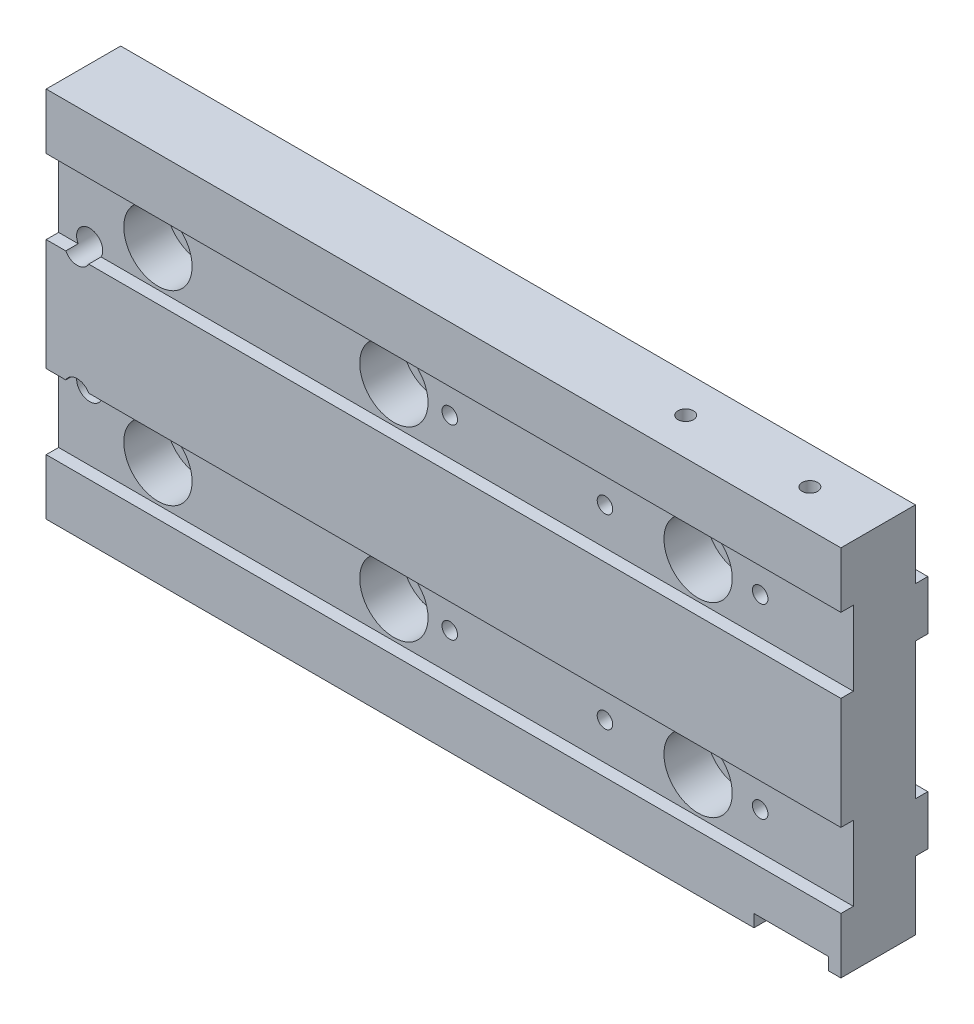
ISO-10303-21;
HEADER;
FILE_DESCRIPTION(('STEP AP214'),'2;1');
FILE_NAME('part.step','',(''),(''),'','','');
FILE_SCHEMA(('AUTOMOTIVE_DESIGN { 1 0 10303 214 1 1 1 1 }'));
ENDSEC;
DATA;
#1=APPLICATION_CONTEXT('core data for automotive mechanical design processes');
#2=APPLICATION_PROTOCOL_DEFINITION('international standard','automotive_design',2000,#1);
#3=PRODUCT_CONTEXT('',#1,'mechanical');
#4=PRODUCT('Part','Part','',(#3));
#5=PRODUCT_RELATED_PRODUCT_CATEGORY('part','',(#4));
#6=PRODUCT_DEFINITION_FORMATION('','',#4);
#7=PRODUCT_DEFINITION_CONTEXT('part definition',#1,'design');
#8=PRODUCT_DEFINITION('design','',#6,#7);
#9=PRODUCT_DEFINITION_SHAPE('','',#8);
#10=(LENGTH_UNIT() NAMED_UNIT(*) SI_UNIT(.MILLI.,.METRE.));
#11=(NAMED_UNIT(*) PLANE_ANGLE_UNIT() SI_UNIT($,.RADIAN.));
#12=(NAMED_UNIT(*) SI_UNIT($,.STERADIAN.) SOLID_ANGLE_UNIT());
#13=UNCERTAINTY_MEASURE_WITH_UNIT(LENGTH_MEASURE(1.E-05),#10,'distance_accuracy_value','');
#14=(GEOMETRIC_REPRESENTATION_CONTEXT(3) GLOBAL_UNCERTAINTY_ASSIGNED_CONTEXT((#13)) GLOBAL_UNIT_ASSIGNED_CONTEXT((#10,
#11,#12)) REPRESENTATION_CONTEXT('',''));
#15=CARTESIAN_POINT('',(0.,0.,0.));
#16=DIRECTION('',(0.,0.,1.));
#17=DIRECTION('',(1.,0.,0.));
#18=AXIS2_PLACEMENT_3D('',#15,#16,#17);
#19=CARTESIAN_POINT('',(-98.2149386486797,-30.0000004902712,12.));
#20=DIRECTION('',(0.,1.,0.));
#21=DIRECTION('',(0.,0.,1.));
#22=AXIS2_PLACEMENT_3D('',#19,#20,#21);
#23=PLANE('',#22);
#24=DIRECTION('',(1.,0.,0.));
#25=VECTOR('',#24,1.);
#26=CARTESIAN_POINT('',(-98.2149386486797,-30.0000004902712,12.));
#27=LINE('',#26,#25);
#28=CARTESIAN_POINT('',(27.7850613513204,-30.0000004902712,12.));
#29=VERTEX_POINT('',#28);
#30=CARTESIAN_POINT('',(29.7850613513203,-30.0000004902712,12.));
#31=VERTEX_POINT('',#30);
#32=EDGE_CURVE('E348',#29,#31,#27,.T.);
#33=ORIENTED_EDGE('',*,*,#32,.F.);
#34=DIRECTION('',(0.,0.,1.));
#35=VECTOR('',#34,1.);
#36=CARTESIAN_POINT('',(27.7850613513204,-30.0000004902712,-2.000025));
#37=LINE('',#36,#35);
#38=CARTESIAN_POINT('',(27.7850613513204,-30.0000004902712,0.));
#39=VERTEX_POINT('',#38);
#40=EDGE_CURVE('E691',#39,#29,#37,.T.);
#41=ORIENTED_EDGE('',*,*,#40,.F.);
#42=DIRECTION('',(1.,0.,0.));
#43=VECTOR('',#42,1.);
#44=CARTESIAN_POINT('',(-98.2149386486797,-30.0000004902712,0.));
#45=LINE('',#44,#43);
#46=CARTESIAN_POINT('',(29.7850613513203,-30.0000004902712,0.));
#47=VERTEX_POINT('',#46);
#48=EDGE_CURVE('E297',#39,#47,#45,.T.);
#49=ORIENTED_EDGE('',*,*,#48,.T.);
#50=DIRECTION('',(0.,0.,-1.));
#51=VECTOR('',#50,1.);
#52=CARTESIAN_POINT('',(29.7850613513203,-30.0000004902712,12.));
#53=LINE('',#52,#51);
#54=EDGE_CURVE('E326',#31,#47,#53,.T.);
#55=ORIENTED_EDGE('',*,*,#54,.F.);
#56=EDGE_LOOP('',(#33,#41,#49,#55));
#57=FACE_BOUND('',#56,.T.);
#58=ADVANCED_FACE('F16',(#57),#23,.F.);
#59=CARTESIAN_POINT('',(29.7850613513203,-11.0000004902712,0.));
#60=DIRECTION('',(0.,1.,0.));
#61=DIRECTION('',(0.,0.,1.));
#62=AXIS2_PLACEMENT_3D('',#59,#60,#61);
#63=PLANE('',#62);
#64=DIRECTION('',(0.,0.,1.));
#65=VECTOR('',#64,1.);
#66=CARTESIAN_POINT('',(-95.0615571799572,-11.0000004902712,12.));
#67=LINE('',#66,#65);
#68=CARTESIAN_POINT('',(-95.0615571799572,-11.0000004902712,-2.));
#69=VERTEX_POINT('',#68);
#70=CARTESIAN_POINT('',(-95.0615571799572,-11.0000004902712,0.));
#71=VERTEX_POINT('',#70);
#72=EDGE_CURVE('E677',#69,#71,#67,.T.);
#73=ORIENTED_EDGE('',*,*,#72,.F.);
#74=DIRECTION('',(-1.,0.,0.));
#75=VECTOR('',#74,1.);
#76=CARTESIAN_POINT('',(29.7850613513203,-11.0000004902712,-2.));
#77=LINE('',#76,#75);
#78=CARTESIAN_POINT('',(-98.2149386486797,-11.0000004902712,-2.));
#79=VERTEX_POINT('',#78);
#80=EDGE_CURVE('E679',#69,#79,#77,.T.);
#81=ORIENTED_EDGE('',*,*,#80,.T.);
#82=DIRECTION('',(0.,0.,-1.));
#83=VECTOR('',#82,1.);
#84=CARTESIAN_POINT('',(-98.2149386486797,-11.0000004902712,0.));
#85=LINE('',#84,#83);
#86=CARTESIAN_POINT('',(-98.2149386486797,-11.0000004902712,0.));
#87=VERTEX_POINT('',#86);
#88=EDGE_CURVE('E564',#87,#79,#85,.T.);
#89=ORIENTED_EDGE('',*,*,#88,.F.);
#90=DIRECTION('',(-1.,0.,0.));
#91=VECTOR('',#90,1.);
#92=CARTESIAN_POINT('',(29.7850613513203,-11.0000004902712,0.));
#93=LINE('',#92,#91);
#94=EDGE_CURVE('E363',#71,#87,#93,.T.);
#95=ORIENTED_EDGE('',*,*,#94,.F.);
#96=EDGE_LOOP('',(#73,#81,#89,#95));
#97=FACE_BOUND('',#96,.T.);
#98=ADVANCED_FACE('F258',(#97),#63,.T.);
#99=CARTESIAN_POINT('',(29.7851113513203,-9.0000004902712,12.));
#100=DIRECTION('',(0.,1.,0.));
#101=DIRECTION('',(0.,0.,1.));
#102=AXIS2_PLACEMENT_3D('',#99,#100,#101);
#103=PLANE('',#102);
#104=DIRECTION('',(-1.,0.,0.));
#105=VECTOR('',#104,1.);
#106=CARTESIAN_POINT('',(29.7851113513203,-9.0000004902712,10.));
#107=LINE('',#106,#105);
#108=CARTESIAN_POINT('',(-95.0615571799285,-9.0000004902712,10.));
#109=VERTEX_POINT('',#108);
#110=CARTESIAN_POINT('',(-98.2149386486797,-9.0000004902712,10.));
#111=VERTEX_POINT('',#110);
#112=EDGE_CURVE('E531',#109,#111,#107,.T.);
#113=ORIENTED_EDGE('',*,*,#112,.F.);
#114=DIRECTION('',(0.,0.,1.));
#115=VECTOR('',#114,1.);
#116=CARTESIAN_POINT('',(-95.0615571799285,-9.0000004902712,12.));
#117=LINE('',#116,#115);
#118=CARTESIAN_POINT('',(-95.0615571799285,-9.0000004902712,12.));
#119=VERTEX_POINT('',#118);
#120=EDGE_CURVE('E367',#109,#119,#117,.T.);
#121=ORIENTED_EDGE('',*,*,#120,.T.);
#122=DIRECTION('',(1.,0.,0.));
#123=VECTOR('',#122,1.);
#124=CARTESIAN_POINT('',(0.,-9.0000004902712,12.));
#125=LINE('',#124,#123);
#126=CARTESIAN_POINT('',(-98.2149386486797,-9.0000004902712,12.));
#127=VERTEX_POINT('',#126);
#128=EDGE_CURVE('E502',#127,#119,#125,.T.);
#129=ORIENTED_EDGE('',*,*,#128,.F.);
#130=DIRECTION('',(0.,0.,-1.));
#131=VECTOR('',#130,1.);
#132=CARTESIAN_POINT('',(-98.2149386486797,-9.0000004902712,12.));
#133=LINE('',#132,#131);
#134=EDGE_CURVE('E513',#127,#111,#133,.T.);
#135=ORIENTED_EDGE('',*,*,#134,.T.);
#136=EDGE_LOOP('',(#113,#121,#129,#135));
#137=FACE_BOUND('',#136,.T.);
#138=ADVANCED_FACE('F265',(#137),#103,.F.);
#139=CARTESIAN_POINT('',(29.7850613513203,11.0000004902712,0.));
#140=DIRECTION('',(0.,-1.,0.));
#141=DIRECTION('',(0.,0.,-1.));
#142=AXIS2_PLACEMENT_3D('',#139,#140,#141);
#143=PLANE('',#142);
#144=DIRECTION('',(0.,0.,1.));
#145=VECTOR('',#144,1.);
#146=CARTESIAN_POINT('',(-91.3683206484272,11.0000004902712,12.));
#147=LINE('',#146,#145);
#148=CARTESIAN_POINT('',(-91.3683206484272,11.0000004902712,-2.));
#149=VERTEX_POINT('',#148);
#150=CARTESIAN_POINT('',(-91.3683206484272,11.0000004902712,0.));
#151=VERTEX_POINT('',#150);
#152=EDGE_CURVE('E728',#149,#151,#147,.T.);
#153=ORIENTED_EDGE('',*,*,#152,.F.);
#154=DIRECTION('',(-1.,0.,0.));
#155=VECTOR('',#154,1.);
#156=CARTESIAN_POINT('',(29.7850613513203,11.0000004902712,-2.));
#157=LINE('',#156,#155);
#158=CARTESIAN_POINT('',(29.7850613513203,11.0000004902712,-2.));
#159=VERTEX_POINT('',#158);
#160=EDGE_CURVE('E569',#159,#149,#157,.T.);
#161=ORIENTED_EDGE('',*,*,#160,.F.);
#162=DIRECTION('',(0.,0.,1.));
#163=VECTOR('',#162,1.);
#164=CARTESIAN_POINT('',(29.7850613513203,11.0000004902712,0.));
#165=LINE('',#164,#163);
#166=CARTESIAN_POINT('',(29.7850613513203,11.0000004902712,0.));
#167=VERTEX_POINT('',#166);
#168=EDGE_CURVE('E551',#159,#167,#165,.T.);
#169=ORIENTED_EDGE('',*,*,#168,.T.);
#170=DIRECTION('',(-1.,0.,0.));
#171=VECTOR('',#170,1.);
#172=CARTESIAN_POINT('',(29.7850613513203,11.0000004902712,0.));
#173=LINE('',#172,#171);
#174=EDGE_CURVE('E565',#167,#151,#173,.T.);
#175=ORIENTED_EDGE('',*,*,#174,.T.);
#176=EDGE_LOOP('',(#153,#161,#169,#175));
#177=FACE_BOUND('',#176,.T.);
#178=ADVANCED_FACE('F451',(#177),#143,.T.);
#179=CARTESIAN_POINT('',(29.7851113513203,9.0000004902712,12.));
#180=DIRECTION('',(0.,-1.,0.));
#181=DIRECTION('',(0.,0.,-1.));
#182=AXIS2_PLACEMENT_3D('',#179,#180,#181);
#183=PLANE('',#182);
#184=DIRECTION('',(-1.,0.,0.));
#185=VECTOR('',#184,1.);
#186=CARTESIAN_POINT('',(29.7851113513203,9.0000004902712,10.));
#187=LINE('',#186,#185);
#188=CARTESIAN_POINT('',(29.7850613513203,9.0000004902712,10.));
#189=VERTEX_POINT('',#188);
#190=CARTESIAN_POINT('',(-91.3683195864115,9.0000004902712,10.));
#191=VERTEX_POINT('',#190);
#192=EDGE_CURVE('E819',#189,#191,#187,.T.);
#193=ORIENTED_EDGE('',*,*,#192,.T.);
#194=DIRECTION('',(0.,0.,1.));
#195=VECTOR('',#194,1.);
#196=CARTESIAN_POINT('',(-91.3683195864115,9.0000004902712,12.));
#197=LINE('',#196,#195);
#198=CARTESIAN_POINT('',(-91.3683195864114,9.0000004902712,12.));
#199=VERTEX_POINT('',#198);
#200=EDGE_CURVE('E722',#191,#199,#197,.T.);
#201=ORIENTED_EDGE('',*,*,#200,.T.);
#202=DIRECTION('',(-1.,0.,0.));
#203=VECTOR('',#202,1.);
#204=CARTESIAN_POINT('',(0.,9.0000004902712,12.));
#205=LINE('',#204,#203);
#206=CARTESIAN_POINT('',(29.7850613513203,9.0000004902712,12.));
#207=VERTEX_POINT('',#206);
#208=EDGE_CURVE('E601',#207,#199,#205,.T.);
#209=ORIENTED_EDGE('',*,*,#208,.F.);
#210=DIRECTION('',(0.,0.,1.));
#211=VECTOR('',#210,1.);
#212=CARTESIAN_POINT('',(29.7850613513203,9.0000004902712,12.));
#213=LINE('',#212,#211);
#214=EDGE_CURVE('E526',#189,#207,#213,.T.);
#215=ORIENTED_EDGE('',*,*,#214,.F.);
#216=EDGE_LOOP('',(#193,#201,#209,#215));
#217=FACE_BOUND('',#216,.T.);
#218=ADVANCED_FACE('F425',(#217),#183,.F.);
#219=CARTESIAN_POINT('',(0.,0.,12.));
#220=DIRECTION('',(0.,0.,-1.));
#221=DIRECTION('',(-1.,0.,0.));
#222=AXIS2_PLACEMENT_3D('',#219,#220,#221);
#223=PLANE('',#222);
#224=DIRECTION('',(0.,-1.,0.));
#225=VECTOR('',#224,1.);
#226=CARTESIAN_POINT('',(-98.2149386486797,-30.0000004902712,12.));
#227=LINE('',#226,#225);
#228=CARTESIAN_POINT('',(-98.2149386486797,29.9999995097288,12.));
#229=VERTEX_POINT('',#228);
#230=CARTESIAN_POINT('',(-98.2149386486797,21.0000004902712,12.));
#231=VERTEX_POINT('',#230);
#232=EDGE_CURVE('E349',#229,#231,#227,.T.);
#233=ORIENTED_EDGE('',*,*,#232,.T.);
#234=DIRECTION('',(1.,0.,0.));
#235=VECTOR('',#234,1.);
#236=CARTESIAN_POINT('',(0.,21.0000004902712,12.));
#237=LINE('',#236,#235);
#238=CARTESIAN_POINT('',(29.7850613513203,21.0000004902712,12.));
#239=VERTEX_POINT('',#238);
#240=EDGE_CURVE('E604',#231,#239,#237,.T.);
#241=ORIENTED_EDGE('',*,*,#240,.T.);
#242=DIRECTION('',(0.,1.,0.));
#243=VECTOR('',#242,1.);
#244=CARTESIAN_POINT('',(29.7850613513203,-30.0000004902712,12.));
#245=LINE('',#244,#243);
#246=CARTESIAN_POINT('',(29.7850613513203,29.9999995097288,12.));
#247=VERTEX_POINT('',#246);
#248=EDGE_CURVE('E344',#239,#247,#245,.T.);
#249=ORIENTED_EDGE('',*,*,#248,.T.);
#250=DIRECTION('',(-1.,0.,0.));
#251=VECTOR('',#250,1.);
#252=CARTESIAN_POINT('',(-98.2149386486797,29.9999995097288,12.));
#253=LINE('',#252,#251);
#254=EDGE_CURVE('E333',#247,#229,#253,.T.);
#255=ORIENTED_EDGE('',*,*,#254,.T.);
#256=EDGE_LOOP('',(#233,#241,#249,#255));
#257=FACE_BOUND('',#256,.T.);
#258=ADVANCED_FACE('F473',(#257),#223,.F.);
#259=DIRECTION('',(-1.,0.,0.));
#260=VECTOR('',#259,1.);
#261=CARTESIAN_POINT('',(27.7850613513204,-28.0000004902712,12.));
#262=LINE('',#261,#260);
#263=CARTESIAN_POINT('',(27.7850613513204,-28.0000004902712,12.));
#264=VERTEX_POINT('',#263);
#265=CARTESIAN_POINT('',(15.7850613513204,-28.0000004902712,12.));
#266=VERTEX_POINT('',#265);
#267=EDGE_CURVE('E704',#264,#266,#262,.T.);
#268=ORIENTED_EDGE('',*,*,#267,.F.);
#269=DIRECTION('',(0.,1.,0.));
#270=VECTOR('',#269,1.);
#271=CARTESIAN_POINT('',(27.7850613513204,-30.0000004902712,12.));
#272=LINE('',#271,#270);
#273=EDGE_CURVE('E699',#29,#264,#272,.T.);
#274=ORIENTED_EDGE('',*,*,#273,.F.);
#275=ORIENTED_EDGE('',*,*,#32,.T.);
#276=CARTESIAN_POINT('',(29.7850613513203,-21.0000004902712,12.));
#277=VERTEX_POINT('',#276);
#278=EDGE_CURVE('E337',#31,#277,#245,.T.);
#279=ORIENTED_EDGE('',*,*,#278,.T.);
#280=DIRECTION('',(-1.,0.,0.));
#281=VECTOR('',#280,1.);
#282=CARTESIAN_POINT('',(0.,-21.0000004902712,12.));
#283=LINE('',#282,#281);
#284=CARTESIAN_POINT('',(-98.2149386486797,-21.0000004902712,12.));
#285=VERTEX_POINT('',#284);
#286=EDGE_CURVE('E515',#277,#285,#283,.T.);
#287=ORIENTED_EDGE('',*,*,#286,.T.);
#288=CARTESIAN_POINT('',(-98.2149386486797,-30.0000004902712,12.));
#289=VERTEX_POINT('',#288);
#290=EDGE_CURVE('E352',#285,#289,#227,.T.);
#291=ORIENTED_EDGE('',*,*,#290,.T.);
#292=CARTESIAN_POINT('',(15.7850613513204,-30.0000004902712,12.));
#293=VERTEX_POINT('',#292);
#294=EDGE_CURVE('E346',#289,#293,#27,.T.);
#295=ORIENTED_EDGE('',*,*,#294,.T.);
#296=DIRECTION('',(0.,-1.,0.));
#297=VECTOR('',#296,1.);
#298=CARTESIAN_POINT('',(15.7850613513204,-30.0000004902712,12.));
#299=LINE('',#298,#297);
#300=EDGE_CURVE('E701',#266,#293,#299,.T.);
#301=ORIENTED_EDGE('',*,*,#300,.F.);
#302=EDGE_LOOP('',(#268,#274,#275,#279,#287,#291,#295,#301));
#303=FACE_BOUND('',#302,.T.);
#304=ADVANCED_FACE('F474',(#303),#223,.F.);
#305=CARTESIAN_POINT('',(0.,0.,0.));
#306=DIRECTION('',(0.,0.,-1.));
#307=DIRECTION('',(-1.,0.,0.));
#308=AXIS2_PLACEMENT_3D('',#305,#306,#307);
#309=PLANE('',#308);
#310=DIRECTION('',(-1.,0.,0.));
#311=VECTOR('',#310,1.);
#312=CARTESIAN_POINT('',(29.7850613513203,19.0000004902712,0.));
#313=LINE('',#312,#311);
#314=CARTESIAN_POINT('',(29.7850613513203,19.0000004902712,0.));
#315=VERTEX_POINT('',#314);
#316=CARTESIAN_POINT('',(-98.2149386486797,19.0000004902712,0.));
#317=VERTEX_POINT('',#316);
#318=EDGE_CURVE('E561',#315,#317,#313,.T.);
#319=ORIENTED_EDGE('',*,*,#318,.T.);
#320=DIRECTION('',(0.,-1.,0.));
#321=VECTOR('',#320,1.);
#322=CARTESIAN_POINT('',(-98.2149386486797,-30.0000004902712,0.));
#323=LINE('',#322,#321);
#324=CARTESIAN_POINT('',(-98.2149386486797,29.9999995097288,0.));
#325=VERTEX_POINT('',#324);
#326=EDGE_CURVE('E301',#325,#317,#323,.T.);
#327=ORIENTED_EDGE('',*,*,#326,.F.);
#328=DIRECTION('',(-1.,0.,0.));
#329=VECTOR('',#328,1.);
#330=CARTESIAN_POINT('',(-98.2149386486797,29.9999995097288,0.));
#331=LINE('',#330,#329);
#332=CARTESIAN_POINT('',(29.7850613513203,29.9999995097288,0.));
#333=VERTEX_POINT('',#332);
#334=EDGE_CURVE('E308',#333,#325,#331,.T.);
#335=ORIENTED_EDGE('',*,*,#334,.F.);
#336=DIRECTION('',(0.,1.,0.));
#337=VECTOR('',#336,1.);
#338=CARTESIAN_POINT('',(29.7850613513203,-30.0000004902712,0.));
#339=LINE('',#338,#337);
#340=EDGE_CURVE('E296',#315,#333,#339,.T.);
#341=ORIENTED_EDGE('',*,*,#340,.F.);
#342=EDGE_LOOP('',(#319,#327,#335,#341));
#343=FACE_BOUND('',#342,.T.);
#344=ADVANCED_FACE('F477',(#343),#309,.T.);
#345=CARTESIAN_POINT('',(-93.2149386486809,-10.0000004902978,0.));
#346=DIRECTION('',(0.,0.,-1.));
#347=DIRECTION('',(-1.,0.,0.));
#348=AXIS2_PLACEMENT_3D('',#345,#346,#347);
#349=CIRCLE('',#348,2.1);
#350=CARTESIAN_POINT('',(-91.3683201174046,-11.0000004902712,0.));
#351=VERTEX_POINT('',#350);
#352=EDGE_CURVE('E675',#71,#351,#349,.T.);
#353=ORIENTED_EDGE('',*,*,#352,.F.);
#354=ORIENTED_EDGE('',*,*,#94,.T.);
#355=CARTESIAN_POINT('',(-98.2149386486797,11.0000004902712,0.));
#356=VERTEX_POINT('',#355);
#357=EDGE_CURVE('E320',#356,#87,#323,.T.);
#358=ORIENTED_EDGE('',*,*,#357,.F.);
#359=CARTESIAN_POINT('',(-95.0615566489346,11.0000004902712,0.));
#360=VERTEX_POINT('',#359);
#361=EDGE_CURVE('E568',#360,#356,#173,.T.);
#362=ORIENTED_EDGE('',*,*,#361,.F.);
#363=CARTESIAN_POINT('',(-93.2149386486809,9.99999950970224,0.));
#364=DIRECTION('',(0.,0.,-1.));
#365=DIRECTION('',(-1.,0.,0.));
#366=AXIS2_PLACEMENT_3D('',#363,#364,#365);
#367=CIRCLE('',#366,2.1);
#368=EDGE_CURVE('E730',#151,#360,#367,.T.);
#369=ORIENTED_EDGE('',*,*,#368,.F.);
#370=ORIENTED_EDGE('',*,*,#174,.F.);
#371=CARTESIAN_POINT('',(29.7850613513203,-11.0000004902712,0.));
#372=VERTEX_POINT('',#371);
#373=EDGE_CURVE('E299',#372,#167,#339,.T.);
#374=ORIENTED_EDGE('',*,*,#373,.F.);
#375=EDGE_CURVE('E359',#372,#351,#93,.T.);
#376=ORIENTED_EDGE('',*,*,#375,.T.);
#377=EDGE_LOOP('',(#353,#354,#358,#362,#369,#370,#374,#376));
#378=FACE_BOUND('',#377,.T.);
#379=ADVANCED_FACE('F281',(#378),#309,.T.);
#380=CARTESIAN_POINT('',(-98.2149386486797,-30.0000004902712,12.));
#381=DIRECTION('',(1.,0.,0.));
#382=DIRECTION('',(0.,0.,-1.));
#383=AXIS2_PLACEMENT_3D('',#380,#381,#382);
#384=PLANE('',#383);
#385=DIRECTION('',(0.,-1.,0.));
#386=VECTOR('',#385,1.);
#387=CARTESIAN_POINT('',(-98.2149386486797,21.0000004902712,10.));
#388=LINE('',#387,#386);
#389=CARTESIAN_POINT('',(-98.2149386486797,21.0000004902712,10.));
#390=VERTEX_POINT('',#389);
#391=CARTESIAN_POINT('',(-98.2149386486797,9.0000004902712,10.));
#392=VERTEX_POINT('',#391);
#393=EDGE_CURVE('E813',#390,#392,#388,.T.);
#394=ORIENTED_EDGE('',*,*,#393,.F.);
#395=DIRECTION('',(0.,0.,-1.));
#396=VECTOR('',#395,1.);
#397=CARTESIAN_POINT('',(-98.2149386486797,21.0000004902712,12.));
#398=LINE('',#397,#396);
#399=EDGE_CURVE('E614',#231,#390,#398,.T.);
#400=ORIENTED_EDGE('',*,*,#399,.F.);
#401=ORIENTED_EDGE('',*,*,#232,.F.);
#402=DIRECTION('',(0.,0.,-1.));
#403=VECTOR('',#402,1.);
#404=CARTESIAN_POINT('',(-98.2149386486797,29.9999995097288,12.));
#405=LINE('',#404,#403);
#406=EDGE_CURVE('E331',#229,#325,#405,.T.);
#407=ORIENTED_EDGE('',*,*,#406,.T.);
#408=ORIENTED_EDGE('',*,*,#326,.T.);
#409=DIRECTION('',(0.,0.,-1.));
#410=VECTOR('',#409,1.);
#411=CARTESIAN_POINT('',(-98.2149386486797,19.0000004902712,0.));
#412=LINE('',#411,#410);
#413=CARTESIAN_POINT('',(-98.2149386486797,19.0000004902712,-2.));
#414=VERTEX_POINT('',#413);
#415=EDGE_CURVE('E543',#317,#414,#412,.T.);
#416=ORIENTED_EDGE('',*,*,#415,.T.);
#417=DIRECTION('',(0.,-1.,0.));
#418=VECTOR('',#417,1.);
#419=CARTESIAN_POINT('',(-98.2149386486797,19.0000004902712,-2.));
#420=LINE('',#419,#418);
#421=CARTESIAN_POINT('',(-98.2149386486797,11.0000004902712,-2.));
#422=VERTEX_POINT('',#421);
#423=EDGE_CURVE('E556',#414,#422,#420,.T.);
#424=ORIENTED_EDGE('',*,*,#423,.T.);
#425=DIRECTION('',(0.,0.,1.));
#426=VECTOR('',#425,1.);
#427=CARTESIAN_POINT('',(-98.2149386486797,11.0000004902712,0.));
#428=LINE('',#427,#426);
#429=EDGE_CURVE('E548',#422,#356,#428,.T.);
#430=ORIENTED_EDGE('',*,*,#429,.T.);
#431=ORIENTED_EDGE('',*,*,#357,.T.);
#432=ORIENTED_EDGE('',*,*,#88,.T.);
#433=DIRECTION('',(0.,-1.,0.));
#434=VECTOR('',#433,1.);
#435=CARTESIAN_POINT('',(-98.2149386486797,-19.0000004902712,-2.));
#436=LINE('',#435,#434);
#437=CARTESIAN_POINT('',(-98.2149386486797,-19.0000004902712,-2.));
#438=VERTEX_POINT('',#437);
#439=EDGE_CURVE('E578',#79,#438,#436,.T.);
#440=ORIENTED_EDGE('',*,*,#439,.T.);
#441=DIRECTION('',(0.,0.,1.));
#442=VECTOR('',#441,1.);
#443=CARTESIAN_POINT('',(-98.2149386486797,-19.0000004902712,0.));
#444=LINE('',#443,#442);
#445=CARTESIAN_POINT('',(-98.2149386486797,-19.0000004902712,0.));
#446=VERTEX_POINT('',#445);
#447=EDGE_CURVE('E581',#438,#446,#444,.T.);
#448=ORIENTED_EDGE('',*,*,#447,.T.);
#449=CARTESIAN_POINT('',(-98.2149386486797,-30.0000004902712,0.));
#450=VERTEX_POINT('',#449);
#451=EDGE_CURVE('E318',#446,#450,#323,.T.);
#452=ORIENTED_EDGE('',*,*,#451,.T.);
#453=DIRECTION('',(0.,0.,-1.));
#454=VECTOR('',#453,1.);
#455=CARTESIAN_POINT('',(-98.2149386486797,-30.0000004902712,12.));
#456=LINE('',#455,#454);
#457=EDGE_CURVE('E292',#289,#450,#456,.T.);
#458=ORIENTED_EDGE('',*,*,#457,.F.);
#459=ORIENTED_EDGE('',*,*,#290,.F.);
#460=DIRECTION('',(0.,0.,1.));
#461=VECTOR('',#460,1.);
#462=CARTESIAN_POINT('',(-98.2149386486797,-21.0000004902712,12.));
#463=LINE('',#462,#461);
#464=CARTESIAN_POINT('',(-98.2149386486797,-21.0000004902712,10.));
#465=VERTEX_POINT('',#464);
#466=EDGE_CURVE('E523',#465,#285,#463,.T.);
#467=ORIENTED_EDGE('',*,*,#466,.F.);
#468=DIRECTION('',(0.,-1.,0.));
#469=VECTOR('',#468,1.);
#470=CARTESIAN_POINT('',(-98.2149386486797,-21.0000004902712,10.));
#471=LINE('',#470,#469);
#472=EDGE_CURVE('E520',#111,#465,#471,.T.);
#473=ORIENTED_EDGE('',*,*,#472,.F.);
#474=ORIENTED_EDGE('',*,*,#134,.F.);
#475=CARTESIAN_POINT('',(-98.2149386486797,9.0000004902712,12.));
#476=VERTEX_POINT('',#475);
#477=EDGE_CURVE('E351',#476,#127,#227,.T.);
#478=ORIENTED_EDGE('',*,*,#477,.F.);
#479=DIRECTION('',(0.,0.,1.));
#480=VECTOR('',#479,1.);
#481=CARTESIAN_POINT('',(-98.2149386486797,9.0000004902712,12.));
#482=LINE('',#481,#480);
#483=EDGE_CURVE('E816',#392,#476,#482,.T.);
#484=ORIENTED_EDGE('',*,*,#483,.F.);
#485=EDGE_LOOP('',(#394,#400,#401,#407,#408,#416,#424,#430,#431,#432,#440,#448,#452,#458,#459,
#467,#473,#474,#478,#484));
#486=FACE_BOUND('',#485,.T.);
#487=ADVANCED_FACE('F18',(#486),#384,.F.);
#488=CARTESIAN_POINT('',(15.7850613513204,-30.0000004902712,0.));
#489=VERTEX_POINT('',#488);
#490=EDGE_CURVE('E287',#450,#489,#45,.T.);
#491=ORIENTED_EDGE('',*,*,#490,.T.);
#492=DIRECTION('',(0.,0.,1.));
#493=VECTOR('',#492,1.);
#494=CARTESIAN_POINT('',(15.7850613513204,-30.0000004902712,-2.000025));
#495=LINE('',#494,#493);
#496=EDGE_CURVE('E289',#489,#293,#495,.T.);
#497=ORIENTED_EDGE('',*,*,#496,.T.);
#498=ORIENTED_EDGE('',*,*,#294,.F.);
#499=ORIENTED_EDGE('',*,*,#457,.T.);
#500=EDGE_LOOP('',(#491,#497,#498,#499));
#501=FACE_BOUND('',#500,.T.);
#502=ADVANCED_FACE('F260',(#501),#23,.F.);
#503=CARTESIAN_POINT('',(29.7850613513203,-30.0000004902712,12.));
#504=DIRECTION('',(-1.,0.,0.));
#505=DIRECTION('',(0.,0.,1.));
#506=AXIS2_PLACEMENT_3D('',#503,#504,#505);
#507=PLANE('',#506);
#508=ORIENTED_EDGE('',*,*,#248,.F.);
#509=DIRECTION('',(0.,0.,-1.));
#510=VECTOR('',#509,1.);
#511=CARTESIAN_POINT('',(29.7850613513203,21.0000004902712,12.));
#512=LINE('',#511,#510);
#513=CARTESIAN_POINT('',(29.7850613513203,21.0000004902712,10.));
#514=VERTEX_POINT('',#513);
#515=EDGE_CURVE('E521',#239,#514,#512,.T.);
#516=ORIENTED_EDGE('',*,*,#515,.T.);
#517=DIRECTION('',(0.,-1.,0.));
#518=VECTOR('',#517,1.);
#519=CARTESIAN_POINT('',(29.7850613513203,-30.0000004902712,10.));
#520=LINE('',#519,#518);
#521=EDGE_CURVE('E607',#514,#189,#520,.T.);
#522=ORIENTED_EDGE('',*,*,#521,.T.);
#523=ORIENTED_EDGE('',*,*,#214,.T.);
#524=CARTESIAN_POINT('',(29.7850613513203,-9.0000004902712,12.));
#525=VERTEX_POINT('',#524);
#526=EDGE_CURVE('E342',#525,#207,#245,.T.);
#527=ORIENTED_EDGE('',*,*,#526,.F.);
#528=DIRECTION('',(0.,0.,-1.));
#529=VECTOR('',#528,1.);
#530=CARTESIAN_POINT('',(29.7850613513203,-9.0000004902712,12.));
#531=LINE('',#530,#529);
#532=CARTESIAN_POINT('',(29.7850613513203,-9.0000004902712,10.));
#533=VERTEX_POINT('',#532);
#534=EDGE_CURVE('E534',#525,#533,#531,.T.);
#535=ORIENTED_EDGE('',*,*,#534,.T.);
#536=DIRECTION('',(0.,-1.,0.));
#537=VECTOR('',#536,1.);
#538=CARTESIAN_POINT('',(29.7850613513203,-30.0000004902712,10.));
#539=LINE('',#538,#537);
#540=CARTESIAN_POINT('',(29.7850613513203,-21.0000004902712,10.));
#541=VERTEX_POINT('',#540);
#542=EDGE_CURVE('E598',#533,#541,#539,.T.);
#543=ORIENTED_EDGE('',*,*,#542,.T.);
#544=DIRECTION('',(0.,0.,1.));
#545=VECTOR('',#544,1.);
#546=CARTESIAN_POINT('',(29.7850613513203,-21.0000004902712,12.));
#547=LINE('',#546,#545);
#548=EDGE_CURVE('E540',#541,#277,#547,.T.);
#549=ORIENTED_EDGE('',*,*,#548,.T.);
#550=ORIENTED_EDGE('',*,*,#278,.F.);
#551=ORIENTED_EDGE('',*,*,#54,.T.);
#552=CARTESIAN_POINT('',(29.7850613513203,-19.0000004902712,0.));
#553=VERTEX_POINT('',#552);
#554=EDGE_CURVE('E315',#47,#553,#339,.T.);
#555=ORIENTED_EDGE('',*,*,#554,.T.);
#556=DIRECTION('',(0.,0.,1.));
#557=VECTOR('',#556,1.);
#558=CARTESIAN_POINT('',(29.7850613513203,-19.0000004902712,0.));
#559=LINE('',#558,#557);
#560=CARTESIAN_POINT('',(29.7850613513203,-19.0000004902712,-2.));
#561=VERTEX_POINT('',#560);
#562=EDGE_CURVE('E366',#561,#553,#559,.T.);
#563=ORIENTED_EDGE('',*,*,#562,.F.);
#564=DIRECTION('',(0.,-1.,0.));
#565=VECTOR('',#564,1.);
#566=CARTESIAN_POINT('',(29.7850613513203,-19.0000004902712,-2.));
#567=LINE('',#566,#565);
#568=CARTESIAN_POINT('',(29.7850613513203,-11.0000004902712,-2.));
#569=VERTEX_POINT('',#568);
#570=EDGE_CURVE('E574',#569,#561,#567,.T.);
#571=ORIENTED_EDGE('',*,*,#570,.F.);
#572=DIRECTION('',(0.,0.,-1.));
#573=VECTOR('',#572,1.);
#574=CARTESIAN_POINT('',(29.7850613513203,-11.0000004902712,0.));
#575=LINE('',#574,#573);
#576=EDGE_CURVE('E577',#372,#569,#575,.T.);
#577=ORIENTED_EDGE('',*,*,#576,.F.);
#578=ORIENTED_EDGE('',*,*,#373,.T.);
#579=ORIENTED_EDGE('',*,*,#168,.F.);
#580=DIRECTION('',(0.,-1.,0.));
#581=VECTOR('',#580,1.);
#582=CARTESIAN_POINT('',(29.7850613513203,19.0000004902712,-2.));
#583=LINE('',#582,#581);
#584=CARTESIAN_POINT('',(29.7850613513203,19.0000004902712,-2.));
#585=VERTEX_POINT('',#584);
#586=EDGE_CURVE('E547',#585,#159,#583,.T.);
#587=ORIENTED_EDGE('',*,*,#586,.F.);
#588=DIRECTION('',(0.,0.,-1.));
#589=VECTOR('',#588,1.);
#590=CARTESIAN_POINT('',(29.7850613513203,19.0000004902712,0.));
#591=LINE('',#590,#589);
#592=EDGE_CURVE('E544',#315,#585,#591,.T.);
#593=ORIENTED_EDGE('',*,*,#592,.F.);
#594=ORIENTED_EDGE('',*,*,#340,.T.);
#595=DIRECTION('',(0.,0.,-1.));
#596=VECTOR('',#595,1.);
#597=CARTESIAN_POINT('',(29.7850613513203,29.9999995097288,12.));
#598=LINE('',#597,#596);
#599=EDGE_CURVE('E329',#247,#333,#598,.T.);
#600=ORIENTED_EDGE('',*,*,#599,.F.);
#601=EDGE_LOOP('',(#508,#516,#522,#523,#527,#535,#543,#549,#550,#551,#555,#563,#571,#577,#578,
#579,#587,#593,#594,#600));
#602=FACE_BOUND('',#601,.T.);
#603=ADVANCED_FACE('F272',(#602),#507,.F.);
#604=CARTESIAN_POINT('',(-98.2149386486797,29.9999995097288,12.));
#605=DIRECTION('',(0.,-1.,0.));
#606=DIRECTION('',(0.,0.,-1.));
#607=AXIS2_PLACEMENT_3D('',#604,#605,#606);
#608=PLANE('',#607);
#609=CARTESIAN_POINT('',(-1.21493864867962,29.9999995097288,6.));
#610=DIRECTION('',(0.,1.,0.));
#611=DIRECTION('',(0.,0.,1.));
#612=AXIS2_PLACEMENT_3D('',#609,#610,#611);
#613=CIRCLE('',#612,1.25);
#614=CARTESIAN_POINT('',(-1.21493864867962,29.9999995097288,7.25));
#615=VERTEX_POINT('',#614);
#616=EDGE_CURVE('E486',#615,#615,#613,.T.);
#617=ORIENTED_EDGE('',*,*,#616,.F.);
#618=EDGE_LOOP('',(#617));
#619=FACE_BOUND('',#618,.T.);
#620=CARTESIAN_POINT('',(18.7850613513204,29.9999995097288,6.));
#621=DIRECTION('',(0.,1.,0.));
#622=DIRECTION('',(0.,0.,1.));
#623=AXIS2_PLACEMENT_3D('',#620,#621,#622);
#624=CIRCLE('',#623,1.25);
#625=CARTESIAN_POINT('',(18.7850613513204,29.9999995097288,7.25));
#626=VERTEX_POINT('',#625);
#627=EDGE_CURVE('E490',#626,#626,#624,.T.);
#628=ORIENTED_EDGE('',*,*,#627,.F.);
#629=EDGE_LOOP('',(#628));
#630=FACE_BOUND('',#629,.T.);
#631=ORIENTED_EDGE('',*,*,#334,.T.);
#632=ORIENTED_EDGE('',*,*,#406,.F.);
#633=ORIENTED_EDGE('',*,*,#254,.F.);
#634=ORIENTED_EDGE('',*,*,#599,.T.);
#635=EDGE_LOOP('',(#631,#632,#633,#634));
#636=FACE_BOUND('',#635,.T.);
#637=ADVANCED_FACE('F279',(#619,#630,#636),#608,.F.);
#638=ORIENTED_EDGE('',*,*,#128,.T.);
#639=CARTESIAN_POINT('',(-93.2149386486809,-10.0000004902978,12.));
#640=DIRECTION('',(0.,0.,1.));
#641=DIRECTION('',(1.,0.,0.));
#642=AXIS2_PLACEMENT_3D('',#639,#640,#641);
#643=CIRCLE('',#642,2.1);
#644=CARTESIAN_POINT('',(-91.3683201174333,-9.0000004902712,12.));
#645=VERTEX_POINT('',#644);
#646=EDGE_CURVE('E708',#645,#119,#643,.T.);
#647=ORIENTED_EDGE('',*,*,#646,.F.);
#648=EDGE_CURVE('E325',#645,#525,#125,.T.);
#649=ORIENTED_EDGE('',*,*,#648,.T.);
#650=ORIENTED_EDGE('',*,*,#526,.T.);
#651=ORIENTED_EDGE('',*,*,#208,.T.);
#652=CARTESIAN_POINT('',(-93.2149386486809,9.99999950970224,12.));
#653=DIRECTION('',(0.,0.,1.));
#654=DIRECTION('',(1.,0.,0.));
#655=AXIS2_PLACEMENT_3D('',#652,#653,#654);
#656=CIRCLE('',#655,2.1);
#657=CARTESIAN_POINT('',(-95.0615577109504,9.0000004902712,12.));
#658=VERTEX_POINT('',#657);
#659=EDGE_CURVE('E717',#658,#199,#656,.T.);
#660=ORIENTED_EDGE('',*,*,#659,.F.);
#661=EDGE_CURVE('E505',#658,#476,#205,.T.);
#662=ORIENTED_EDGE('',*,*,#661,.T.);
#663=ORIENTED_EDGE('',*,*,#477,.T.);
#664=EDGE_LOOP('',(#638,#647,#649,#650,#651,#660,#662,#663));
#665=FACE_BOUND('',#664,.T.);
#666=ADVANCED_FACE('F469',(#665),#223,.F.);
#667=DIRECTION('',(0.,-1.,0.));
#668=VECTOR('',#667,1.);
#669=CARTESIAN_POINT('',(27.7850613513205,-1.44598194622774E-13,0.));
#670=LINE('',#669,#668);
#671=CARTESIAN_POINT('',(27.7850613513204,-28.0000004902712,0.));
#672=VERTEX_POINT('',#671);
#673=EDGE_CURVE('E373',#672,#39,#670,.T.);
#674=ORIENTED_EDGE('',*,*,#673,.F.);
#675=DIRECTION('',(1.,0.,0.));
#676=VECTOR('',#675,1.);
#677=CARTESIAN_POINT('',(0.,-28.0000004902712,0.));
#678=LINE('',#677,#676);
#679=CARTESIAN_POINT('',(15.7850613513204,-28.0000004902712,0.));
#680=VERTEX_POINT('',#679);
#681=EDGE_CURVE('E369',#680,#672,#678,.T.);
#682=ORIENTED_EDGE('',*,*,#681,.F.);
#683=DIRECTION('',(0.,1.,0.));
#684=VECTOR('',#683,1.);
#685=CARTESIAN_POINT('',(15.7850613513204,0.,0.));
#686=LINE('',#685,#684);
#687=EDGE_CURVE('E371',#489,#680,#686,.T.);
#688=ORIENTED_EDGE('',*,*,#687,.F.);
#689=ORIENTED_EDGE('',*,*,#490,.F.);
#690=ORIENTED_EDGE('',*,*,#451,.F.);
#691=DIRECTION('',(-1.,0.,0.));
#692=VECTOR('',#691,1.);
#693=CARTESIAN_POINT('',(29.7850613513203,-19.0000004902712,0.));
#694=LINE('',#693,#692);
#695=EDGE_CURVE('E321',#553,#446,#694,.T.);
#696=ORIENTED_EDGE('',*,*,#695,.F.);
#697=ORIENTED_EDGE('',*,*,#554,.F.);
#698=ORIENTED_EDGE('',*,*,#48,.F.);
#699=EDGE_LOOP('',(#674,#682,#688,#689,#690,#696,#697,#698));
#700=FACE_BOUND('',#699,.T.);
#701=ADVANCED_FACE('F462',(#700),#309,.T.);
#702=CARTESIAN_POINT('',(29.7850613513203,-19.0000004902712,0.));
#703=DIRECTION('',(0.,-1.,0.));
#704=DIRECTION('',(0.,0.,-1.));
#705=AXIS2_PLACEMENT_3D('',#702,#703,#704);
#706=PLANE('',#705);
#707=ORIENTED_EDGE('',*,*,#447,.F.);
#708=DIRECTION('',(-1.,0.,0.));
#709=VECTOR('',#708,1.);
#710=CARTESIAN_POINT('',(29.7850613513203,-19.0000004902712,-2.));
#711=LINE('',#710,#709);
#712=EDGE_CURVE('E583',#561,#438,#711,.T.);
#713=ORIENTED_EDGE('',*,*,#712,.F.);
#714=ORIENTED_EDGE('',*,*,#562,.T.);
#715=ORIENTED_EDGE('',*,*,#695,.T.);
#716=EDGE_LOOP('',(#707,#713,#714,#715));
#717=FACE_BOUND('',#716,.T.);
#718=ADVANCED_FACE('F458',(#717),#706,.T.);
#719=CARTESIAN_POINT('',(29.7850613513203,-19.0000004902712,-2.));
#720=DIRECTION('',(0.,0.,-1.));
#721=DIRECTION('',(-1.,0.,0.));
#722=AXIS2_PLACEMENT_3D('',#719,#720,#721);
#723=PLANE('',#722);
#724=CARTESIAN_POINT('',(-93.2149386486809,-10.0000004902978,-2.));
#725=DIRECTION('',(0.,0.,-1.));
#726=DIRECTION('',(-1.,0.,0.));
#727=AXIS2_PLACEMENT_3D('',#724,#725,#726);
#728=CIRCLE('',#727,2.1);
#729=CARTESIAN_POINT('',(-91.3683201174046,-11.0000004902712,-2.));
#730=VERTEX_POINT('',#729);
#731=EDGE_CURVE('E713',#730,#69,#728,.T.);
#732=ORIENTED_EDGE('',*,*,#731,.F.);
#733=EDGE_CURVE('E355',#569,#730,#77,.T.);
#734=ORIENTED_EDGE('',*,*,#733,.F.);
#735=ORIENTED_EDGE('',*,*,#570,.T.);
#736=ORIENTED_EDGE('',*,*,#712,.T.);
#737=ORIENTED_EDGE('',*,*,#439,.F.);
#738=ORIENTED_EDGE('',*,*,#80,.F.);
#739=EDGE_LOOP('',(#732,#734,#735,#736,#737,#738));
#740=FACE_BOUND('',#739,.T.);
#741=CARTESIAN_POINT('',(-35.2149386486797,-15.0000008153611,-2.));
#742=DIRECTION('',(0.,0.,-1.));
#743=DIRECTION('',(-1.,0.,0.));
#744=AXIS2_PLACEMENT_3D('',#741,#742,#743);
#745=CIRCLE('',#744,1.25);
#746=CARTESIAN_POINT('',(-36.4649386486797,-15.0000008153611,-2.));
#747=VERTEX_POINT('',#746);
#748=EDGE_CURVE('E735',#747,#747,#745,.T.);
#749=ORIENTED_EDGE('',*,*,#748,.F.);
#750=EDGE_LOOP('',(#749));
#751=FACE_BOUND('',#750,.T.);
#752=CARTESIAN_POINT('',(-10.2149386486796,-15.0000008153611,-2.));
#753=DIRECTION('',(0.,0.,-1.));
#754=DIRECTION('',(-1.,0.,0.));
#755=AXIS2_PLACEMENT_3D('',#752,#753,#754);
#756=CIRCLE('',#755,1.25);
#757=CARTESIAN_POINT('',(-11.4649386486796,-15.0000008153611,-2.));
#758=VERTEX_POINT('',#757);
#759=EDGE_CURVE('E741',#758,#758,#756,.T.);
#760=ORIENTED_EDGE('',*,*,#759,.F.);
#761=EDGE_LOOP('',(#760));
#762=FACE_BOUND('',#761,.T.);
#763=CARTESIAN_POINT('',(14.7850613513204,-15.0000008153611,-2.));
#764=DIRECTION('',(0.,0.,-1.));
#765=DIRECTION('',(-1.,0.,0.));
#766=AXIS2_PLACEMENT_3D('',#763,#764,#765);
#767=CIRCLE('',#766,1.25);
#768=CARTESIAN_POINT('',(13.5350613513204,-15.0000008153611,-2.));
#769=VERTEX_POINT('',#768);
#770=EDGE_CURVE('E747',#769,#769,#767,.T.);
#771=ORIENTED_EDGE('',*,*,#770,.F.);
#772=EDGE_LOOP('',(#771));
#773=FACE_BOUND('',#772,.T.);
#774=CARTESIAN_POINT('',(-82.2149386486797,-15.0000004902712,-2.));
#775=DIRECTION('',(0.,0.,-1.));
#776=DIRECTION('',(-1.,0.,0.));
#777=AXIS2_PLACEMENT_3D('',#774,#775,#776);
#778=CIRCLE('',#777,3.3);
#779=CARTESIAN_POINT('',(-85.5149386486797,-15.0000004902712,-2.));
#780=VERTEX_POINT('',#779);
#781=EDGE_CURVE('E636',#780,#780,#778,.T.);
#782=ORIENTED_EDGE('',*,*,#781,.F.);
#783=EDGE_LOOP('',(#782));
#784=FACE_BOUND('',#783,.T.);
#785=CARTESIAN_POINT('',(-44.2149386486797,-15.0000004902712,-2.));
#786=DIRECTION('',(0.,0.,-1.));
#787=DIRECTION('',(-1.,0.,0.));
#788=AXIS2_PLACEMENT_3D('',#785,#786,#787);
#789=CIRCLE('',#788,3.3);
#790=CARTESIAN_POINT('',(-47.5149386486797,-15.0000004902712,-2.));
#791=VERTEX_POINT('',#790);
#792=EDGE_CURVE('E631',#791,#791,#789,.T.);
#793=ORIENTED_EDGE('',*,*,#792,.F.);
#794=EDGE_LOOP('',(#793));
#795=FACE_BOUND('',#794,.T.);
#796=CARTESIAN_POINT('',(4.78506135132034,-15.0000004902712,-2.));
#797=DIRECTION('',(0.,0.,-1.));
#798=DIRECTION('',(-1.,0.,0.));
#799=AXIS2_PLACEMENT_3D('',#796,#797,#798);
#800=CIRCLE('',#799,3.3);
#801=CARTESIAN_POINT('',(1.48506135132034,-15.0000004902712,-2.));
#802=VERTEX_POINT('',#801);
#803=EDGE_CURVE('E626',#802,#802,#800,.T.);
#804=ORIENTED_EDGE('',*,*,#803,.F.);
#805=EDGE_LOOP('',(#804));
#806=FACE_BOUND('',#805,.T.);
#807=ADVANCED_FACE('F461',(#740,#751,#762,#773,#784,#795,#806),#723,.T.);
#808=DIRECTION('',(0.,0.,1.));
#809=VECTOR('',#808,1.);
#810=CARTESIAN_POINT('',(-91.3683201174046,-11.0000004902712,12.));
#811=LINE('',#810,#809);
#812=EDGE_CURVE('E711',#351,#730,#811,.F.);
#813=ORIENTED_EDGE('',*,*,#812,.F.);
#814=ORIENTED_EDGE('',*,*,#375,.F.);
#815=ORIENTED_EDGE('',*,*,#576,.T.);
#816=ORIENTED_EDGE('',*,*,#733,.T.);
#817=EDGE_LOOP('',(#813,#814,#815,#816));
#818=FACE_BOUND('',#817,.T.);
#819=ADVANCED_FACE('F268',(#818),#63,.T.);
#820=CARTESIAN_POINT('',(29.7850613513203,19.0000004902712,0.));
#821=DIRECTION('',(0.,1.,0.));
#822=DIRECTION('',(0.,0.,1.));
#823=AXIS2_PLACEMENT_3D('',#820,#821,#822);
#824=PLANE('',#823);
#825=ORIENTED_EDGE('',*,*,#415,.F.);
#826=ORIENTED_EDGE('',*,*,#318,.F.);
#827=ORIENTED_EDGE('',*,*,#592,.T.);
#828=DIRECTION('',(-1.,0.,0.));
#829=VECTOR('',#828,1.);
#830=CARTESIAN_POINT('',(29.7850613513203,19.0000004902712,-2.));
#831=LINE('',#830,#829);
#832=EDGE_CURVE('E553',#585,#414,#831,.T.);
#833=ORIENTED_EDGE('',*,*,#832,.T.);
#834=EDGE_LOOP('',(#825,#826,#827,#833));
#835=FACE_BOUND('',#834,.T.);
#836=ADVANCED_FACE('F449',(#835),#824,.T.);
#837=DIRECTION('',(0.,0.,1.));
#838=VECTOR('',#837,1.);
#839=CARTESIAN_POINT('',(-95.0615566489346,11.0000004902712,12.));
#840=LINE('',#839,#838);
#841=CARTESIAN_POINT('',(-95.0615566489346,11.0000004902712,-2.));
#842=VERTEX_POINT('',#841);
#843=EDGE_CURVE('E726',#360,#842,#840,.F.);
#844=ORIENTED_EDGE('',*,*,#843,.F.);
#845=ORIENTED_EDGE('',*,*,#361,.T.);
#846=ORIENTED_EDGE('',*,*,#429,.F.);
#847=EDGE_CURVE('E572',#842,#422,#157,.T.);
#848=ORIENTED_EDGE('',*,*,#847,.F.);
#849=EDGE_LOOP('',(#844,#845,#846,#848));
#850=FACE_BOUND('',#849,.T.);
#851=ADVANCED_FACE('F446',(#850),#143,.T.);
#852=CARTESIAN_POINT('',(29.7850613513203,19.0000004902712,-2.));
#853=DIRECTION('',(0.,0.,-1.));
#854=DIRECTION('',(-1.,0.,0.));
#855=AXIS2_PLACEMENT_3D('',#852,#853,#854);
#856=PLANE('',#855);
#857=CARTESIAN_POINT('',(-93.2149386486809,9.99999950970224,-2.));
#858=DIRECTION('',(0.,0.,-1.));
#859=DIRECTION('',(-1.,0.,0.));
#860=AXIS2_PLACEMENT_3D('',#857,#858,#859);
#861=CIRCLE('',#860,2.1);
#862=EDGE_CURVE('E664',#842,#149,#861,.T.);
#863=ORIENTED_EDGE('',*,*,#862,.F.);
#864=ORIENTED_EDGE('',*,*,#847,.T.);
#865=ORIENTED_EDGE('',*,*,#423,.F.);
#866=ORIENTED_EDGE('',*,*,#832,.F.);
#867=ORIENTED_EDGE('',*,*,#586,.T.);
#868=ORIENTED_EDGE('',*,*,#160,.T.);
#869=EDGE_LOOP('',(#863,#864,#865,#866,#867,#868));
#870=FACE_BOUND('',#869,.T.);
#871=CARTESIAN_POINT('',(14.7850613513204,15.0000004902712,-2.));
#872=DIRECTION('',(0.,0.,-1.));
#873=DIRECTION('',(-1.,0.,0.));
#874=AXIS2_PLACEMENT_3D('',#871,#872,#873);
#875=CIRCLE('',#874,1.25);
#876=CARTESIAN_POINT('',(13.5350613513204,15.0000004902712,-2.));
#877=VERTEX_POINT('',#876);
#878=EDGE_CURVE('E753',#877,#877,#875,.T.);
#879=ORIENTED_EDGE('',*,*,#878,.F.);
#880=EDGE_LOOP('',(#879));
#881=FACE_BOUND('',#880,.T.);
#882=CARTESIAN_POINT('',(-10.2149386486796,15.0000004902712,-2.));
#883=DIRECTION('',(0.,0.,-1.));
#884=DIRECTION('',(-1.,0.,0.));
#885=AXIS2_PLACEMENT_3D('',#882,#883,#884);
#886=CIRCLE('',#885,1.25);
#887=CARTESIAN_POINT('',(-11.4649386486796,15.0000004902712,-2.));
#888=VERTEX_POINT('',#887);
#889=EDGE_CURVE('E759',#888,#888,#886,.T.);
#890=ORIENTED_EDGE('',*,*,#889,.F.);
#891=EDGE_LOOP('',(#890));
#892=FACE_BOUND('',#891,.T.);
#893=CARTESIAN_POINT('',(-35.2149386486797,15.0000004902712,-2.));
#894=DIRECTION('',(0.,0.,-1.));
#895=DIRECTION('',(-1.,0.,0.));
#896=AXIS2_PLACEMENT_3D('',#893,#894,#895);
#897=CIRCLE('',#896,1.25);
#898=CARTESIAN_POINT('',(-36.4649386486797,15.0000004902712,-2.));
#899=VERTEX_POINT('',#898);
#900=EDGE_CURVE('E765',#899,#899,#897,.T.);
#901=ORIENTED_EDGE('',*,*,#900,.F.);
#902=EDGE_LOOP('',(#901));
#903=FACE_BOUND('',#902,.T.);
#904=CARTESIAN_POINT('',(4.78506135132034,14.9999995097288,-2.));
#905=DIRECTION('',(0.,0.,-1.));
#906=DIRECTION('',(-1.,0.,0.));
#907=AXIS2_PLACEMENT_3D('',#904,#905,#906);
#908=CIRCLE('',#907,3.3);
#909=CARTESIAN_POINT('',(1.48506135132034,14.9999995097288,-2.));
#910=VERTEX_POINT('',#909);
#911=EDGE_CURVE('E621',#910,#910,#908,.T.);
#912=ORIENTED_EDGE('',*,*,#911,.F.);
#913=EDGE_LOOP('',(#912));
#914=FACE_BOUND('',#913,.T.);
#915=CARTESIAN_POINT('',(-44.2149386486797,14.9999995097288,-2.));
#916=DIRECTION('',(0.,0.,-1.));
#917=DIRECTION('',(-1.,0.,0.));
#918=AXIS2_PLACEMENT_3D('',#915,#916,#917);
#919=CIRCLE('',#918,3.3);
#920=CARTESIAN_POINT('',(-47.5149386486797,14.9999995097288,-2.));
#921=VERTEX_POINT('',#920);
#922=EDGE_CURVE('E616',#921,#921,#919,.T.);
#923=ORIENTED_EDGE('',*,*,#922,.F.);
#924=EDGE_LOOP('',(#923));
#925=FACE_BOUND('',#924,.T.);
#926=CARTESIAN_POINT('',(-82.2149386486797,14.9999995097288,-2.));
#927=DIRECTION('',(0.,0.,-1.));
#928=DIRECTION('',(-1.,0.,0.));
#929=AXIS2_PLACEMENT_3D('',#926,#927,#928);
#930=CIRCLE('',#929,3.3);
#931=CARTESIAN_POINT('',(-85.5149386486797,14.9999995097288,-2.));
#932=VERTEX_POINT('',#931);
#933=EDGE_CURVE('E611',#932,#932,#930,.T.);
#934=ORIENTED_EDGE('',*,*,#933,.F.);
#935=EDGE_LOOP('',(#934));
#936=FACE_BOUND('',#935,.T.);
#937=ADVANCED_FACE('F441',(#870,#881,#892,#903,#914,#925,#936),#856,.T.);
#938=CARTESIAN_POINT('',(29.7851113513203,-21.0000004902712,10.));
#939=DIRECTION('',(0.,0.,-1.));
#940=DIRECTION('',(-1.,0.,0.));
#941=AXIS2_PLACEMENT_3D('',#938,#939,#940);
#942=PLANE('',#941);
#943=CARTESIAN_POINT('',(-35.2149386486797,-15.0000008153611,10.));
#944=DIRECTION('',(0.,0.,1.));
#945=DIRECTION('',(1.,0.,0.));
#946=AXIS2_PLACEMENT_3D('',#943,#944,#945);
#947=CIRCLE('',#946,1.25);
#948=CARTESIAN_POINT('',(-33.9649386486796,-15.0000008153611,10.));
#949=VERTEX_POINT('',#948);
#950=EDGE_CURVE('E732',#949,#949,#947,.T.);
#951=ORIENTED_EDGE('',*,*,#950,.F.);
#952=EDGE_LOOP('',(#951));
#953=FACE_BOUND('',#952,.T.);
#954=CARTESIAN_POINT('',(-10.2149386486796,-15.0000008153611,10.));
#955=DIRECTION('',(0.,0.,1.));
#956=DIRECTION('',(1.,0.,0.));
#957=AXIS2_PLACEMENT_3D('',#954,#955,#956);
#958=CIRCLE('',#957,1.25);
#959=CARTESIAN_POINT('',(-8.96493864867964,-15.0000008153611,10.));
#960=VERTEX_POINT('',#959);
#961=EDGE_CURVE('E738',#960,#960,#958,.T.);
#962=ORIENTED_EDGE('',*,*,#961,.F.);
#963=EDGE_LOOP('',(#962));
#964=FACE_BOUND('',#963,.T.);
#965=CARTESIAN_POINT('',(14.7850613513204,-15.0000008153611,10.));
#966=DIRECTION('',(0.,0.,1.));
#967=DIRECTION('',(1.,0.,0.));
#968=AXIS2_PLACEMENT_3D('',#965,#966,#967);
#969=CIRCLE('',#968,1.25);
#970=CARTESIAN_POINT('',(16.0350613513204,-15.0000008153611,10.));
#971=VERTEX_POINT('',#970);
#972=EDGE_CURVE('E744',#971,#971,#969,.T.);
#973=ORIENTED_EDGE('',*,*,#972,.F.);
#974=EDGE_LOOP('',(#973));
#975=FACE_BOUND('',#974,.T.);
#976=CARTESIAN_POINT('',(-82.2149386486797,-15.0000004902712,10.));
#977=DIRECTION('',(0.,0.,1.));
#978=DIRECTION('',(1.,0.,0.));
#979=AXIS2_PLACEMENT_3D('',#976,#977,#978);
#980=CIRCLE('',#979,5.5);
#981=CARTESIAN_POINT('',(-76.7149386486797,-15.0000004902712,10.));
#982=VERTEX_POINT('',#981);
#983=EDGE_CURVE('E768',#982,#982,#980,.T.);
#984=ORIENTED_EDGE('',*,*,#983,.F.);
#985=EDGE_LOOP('',(#984));
#986=FACE_BOUND('',#985,.T.);
#987=CARTESIAN_POINT('',(-44.2149386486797,-15.0000004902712,10.));
#988=DIRECTION('',(0.,0.,1.));
#989=DIRECTION('',(1.,0.,0.));
#990=AXIS2_PLACEMENT_3D('',#987,#988,#989);
#991=CIRCLE('',#990,5.5);
#992=CARTESIAN_POINT('',(-38.7149386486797,-15.0000004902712,10.));
#993=VERTEX_POINT('',#992);
#994=EDGE_CURVE('E639',#993,#993,#991,.T.);
#995=ORIENTED_EDGE('',*,*,#994,.F.);
#996=EDGE_LOOP('',(#995));
#997=FACE_BOUND('',#996,.T.);
#998=CARTESIAN_POINT('',(4.78506135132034,-15.0000004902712,10.));
#999=DIRECTION('',(0.,0.,1.));
#1000=DIRECTION('',(1.,0.,0.));
#1001=AXIS2_PLACEMENT_3D('',#998,#999,#1000);
#1002=CIRCLE('',#1001,5.5);
#1003=CARTESIAN_POINT('',(10.2850613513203,-15.0000004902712,10.));
#1004=VERTEX_POINT('',#1003);
#1005=EDGE_CURVE('E634',#1004,#1004,#1002,.T.);
#1006=ORIENTED_EDGE('',*,*,#1005,.F.);
#1007=EDGE_LOOP('',(#1006));
#1008=FACE_BOUND('',#1007,.T.);
#1009=CARTESIAN_POINT('',(-91.3683201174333,-9.0000004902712,10.));
#1010=VERTEX_POINT('',#1009);
#1011=EDGE_CURVE('E535',#533,#1010,#107,.T.);
#1012=ORIENTED_EDGE('',*,*,#1011,.T.);
#1013=CARTESIAN_POINT('',(-93.2149386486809,-10.0000004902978,10.));
#1014=DIRECTION('',(0.,0.,-1.));
#1015=DIRECTION('',(-1.,0.,0.));
#1016=AXIS2_PLACEMENT_3D('',#1013,#1014,#1015);
#1017=CIRCLE('',#1016,2.1);
#1018=EDGE_CURVE('E650',#1010,#109,#1017,.T.);
#1019=ORIENTED_EDGE('',*,*,#1018,.T.);
#1020=ORIENTED_EDGE('',*,*,#112,.T.);
#1021=ORIENTED_EDGE('',*,*,#472,.T.);
#1022=DIRECTION('',(-1.,0.,0.));
#1023=VECTOR('',#1022,1.);
#1024=CARTESIAN_POINT('',(29.7851113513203,-21.0000004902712,10.));
#1025=LINE('',#1024,#1023);
#1026=EDGE_CURVE('E532',#541,#465,#1025,.T.);
#1027=ORIENTED_EDGE('',*,*,#1026,.F.);
#1028=ORIENTED_EDGE('',*,*,#542,.F.);
#1029=EDGE_LOOP('',(#1012,#1019,#1020,#1021,#1027,#1028));
#1030=FACE_BOUND('',#1029,.T.);
#1031=ADVANCED_FACE('F437',(#953,#964,#975,#986,#997,#1008,#1030),#942,.F.);
#1032=CARTESIAN_POINT('',(29.7851113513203,-21.0000004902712,12.));
#1033=DIRECTION('',(0.,-1.,0.));
#1034=DIRECTION('',(0.,0.,-1.));
#1035=AXIS2_PLACEMENT_3D('',#1032,#1033,#1034);
#1036=PLANE('',#1035);
#1037=ORIENTED_EDGE('',*,*,#1026,.T.);
#1038=ORIENTED_EDGE('',*,*,#466,.T.);
#1039=ORIENTED_EDGE('',*,*,#286,.F.);
#1040=ORIENTED_EDGE('',*,*,#548,.F.);
#1041=EDGE_LOOP('',(#1037,#1038,#1039,#1040));
#1042=FACE_BOUND('',#1041,.T.);
#1043=ADVANCED_FACE('F434',(#1042),#1036,.F.);
#1044=ORIENTED_EDGE('',*,*,#648,.F.);
#1045=DIRECTION('',(0.,0.,1.));
#1046=VECTOR('',#1045,1.);
#1047=CARTESIAN_POINT('',(-91.3683201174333,-9.0000004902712,12.));
#1048=LINE('',#1047,#1046);
#1049=EDGE_CURVE('E642',#645,#1010,#1048,.F.);
#1050=ORIENTED_EDGE('',*,*,#1049,.T.);
#1051=ORIENTED_EDGE('',*,*,#1011,.F.);
#1052=ORIENTED_EDGE('',*,*,#534,.F.);
#1053=EDGE_LOOP('',(#1044,#1050,#1051,#1052));
#1054=FACE_BOUND('',#1053,.T.);
#1055=ADVANCED_FACE('F429',(#1054),#103,.F.);
#1056=CARTESIAN_POINT('',(29.7851113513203,21.0000004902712,10.));
#1057=DIRECTION('',(0.,0.,-1.));
#1058=DIRECTION('',(-1.,0.,0.));
#1059=AXIS2_PLACEMENT_3D('',#1056,#1057,#1058);
#1060=PLANE('',#1059);
#1061=CARTESIAN_POINT('',(14.7850613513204,15.0000004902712,10.));
#1062=DIRECTION('',(0.,0.,1.));
#1063=DIRECTION('',(1.,0.,0.));
#1064=AXIS2_PLACEMENT_3D('',#1061,#1062,#1063);
#1065=CIRCLE('',#1064,1.25);
#1066=CARTESIAN_POINT('',(16.0350613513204,15.0000004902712,10.));
#1067=VERTEX_POINT('',#1066);
#1068=EDGE_CURVE('E750',#1067,#1067,#1065,.T.);
#1069=ORIENTED_EDGE('',*,*,#1068,.F.);
#1070=EDGE_LOOP('',(#1069));
#1071=FACE_BOUND('',#1070,.T.);
#1072=CARTESIAN_POINT('',(-10.2149386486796,15.0000004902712,10.));
#1073=DIRECTION('',(0.,0.,1.));
#1074=DIRECTION('',(1.,0.,0.));
#1075=AXIS2_PLACEMENT_3D('',#1072,#1073,#1074);
#1076=CIRCLE('',#1075,1.25);
#1077=CARTESIAN_POINT('',(-8.96493864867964,15.0000004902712,10.));
#1078=VERTEX_POINT('',#1077);
#1079=EDGE_CURVE('E756',#1078,#1078,#1076,.T.);
#1080=ORIENTED_EDGE('',*,*,#1079,.F.);
#1081=EDGE_LOOP('',(#1080));
#1082=FACE_BOUND('',#1081,.T.);
#1083=CARTESIAN_POINT('',(-35.2149386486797,15.0000004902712,10.));
#1084=DIRECTION('',(0.,0.,1.));
#1085=DIRECTION('',(1.,0.,0.));
#1086=AXIS2_PLACEMENT_3D('',#1083,#1084,#1085);
#1087=CIRCLE('',#1086,1.25);
#1088=CARTESIAN_POINT('',(-33.9649386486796,15.0000004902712,10.));
#1089=VERTEX_POINT('',#1088);
#1090=EDGE_CURVE('E762',#1089,#1089,#1087,.T.);
#1091=ORIENTED_EDGE('',*,*,#1090,.F.);
#1092=EDGE_LOOP('',(#1091));
#1093=FACE_BOUND('',#1092,.T.);
#1094=CARTESIAN_POINT('',(4.78506135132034,14.9999995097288,10.));
#1095=DIRECTION('',(0.,0.,1.));
#1096=DIRECTION('',(1.,0.,0.));
#1097=AXIS2_PLACEMENT_3D('',#1094,#1095,#1096);
#1098=CIRCLE('',#1097,5.5);
#1099=CARTESIAN_POINT('',(10.2850613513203,14.9999995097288,10.));
#1100=VERTEX_POINT('',#1099);
#1101=EDGE_CURVE('E629',#1100,#1100,#1098,.T.);
#1102=ORIENTED_EDGE('',*,*,#1101,.F.);
#1103=EDGE_LOOP('',(#1102));
#1104=FACE_BOUND('',#1103,.T.);
#1105=CARTESIAN_POINT('',(-44.2149386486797,14.9999995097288,10.));
#1106=DIRECTION('',(0.,0.,1.));
#1107=DIRECTION('',(1.,0.,0.));
#1108=AXIS2_PLACEMENT_3D('',#1105,#1106,#1107);
#1109=CIRCLE('',#1108,5.5);
#1110=CARTESIAN_POINT('',(-38.7149386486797,14.9999995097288,10.));
#1111=VERTEX_POINT('',#1110);
#1112=EDGE_CURVE('E624',#1111,#1111,#1109,.T.);
#1113=ORIENTED_EDGE('',*,*,#1112,.F.);
#1114=EDGE_LOOP('',(#1113));
#1115=FACE_BOUND('',#1114,.T.);
#1116=CARTESIAN_POINT('',(-82.2149386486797,14.9999995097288,10.));
#1117=DIRECTION('',(0.,0.,1.));
#1118=DIRECTION('',(1.,0.,0.));
#1119=AXIS2_PLACEMENT_3D('',#1116,#1117,#1118);
#1120=CIRCLE('',#1119,5.5);
#1121=CARTESIAN_POINT('',(-76.7149386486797,14.9999995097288,10.));
#1122=VERTEX_POINT('',#1121);
#1123=EDGE_CURVE('E619',#1122,#1122,#1120,.T.);
#1124=ORIENTED_EDGE('',*,*,#1123,.F.);
#1125=EDGE_LOOP('',(#1124));
#1126=FACE_BOUND('',#1125,.T.);
#1127=CARTESIAN_POINT('',(-95.0615577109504,9.0000004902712,10.));
#1128=VERTEX_POINT('',#1127);
#1129=EDGE_CURVE('E822',#1128,#392,#187,.T.);
#1130=ORIENTED_EDGE('',*,*,#1129,.F.);
#1131=CARTESIAN_POINT('',(-93.2149386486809,9.99999950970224,10.));
#1132=DIRECTION('',(0.,0.,-1.));
#1133=DIRECTION('',(-1.,0.,0.));
#1134=AXIS2_PLACEMENT_3D('',#1131,#1132,#1133);
#1135=CIRCLE('',#1134,2.1);
#1136=EDGE_CURVE('E610',#1128,#191,#1135,.T.);
#1137=ORIENTED_EDGE('',*,*,#1136,.T.);
#1138=ORIENTED_EDGE('',*,*,#192,.F.);
#1139=ORIENTED_EDGE('',*,*,#521,.F.);
#1140=DIRECTION('',(-1.,0.,0.));
#1141=VECTOR('',#1140,1.);
#1142=CARTESIAN_POINT('',(29.7851113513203,21.0000004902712,10.));
#1143=LINE('',#1142,#1141);
#1144=EDGE_CURVE('E818',#514,#390,#1143,.T.);
#1145=ORIENTED_EDGE('',*,*,#1144,.T.);
#1146=ORIENTED_EDGE('',*,*,#393,.T.);
#1147=EDGE_LOOP('',(#1130,#1137,#1138,#1139,#1145,#1146));
#1148=FACE_BOUND('',#1147,.T.);
#1149=ADVANCED_FACE('F426',(#1071,#1082,#1093,#1104,#1115,#1126,#1148),#1060,.F.);
#1150=CARTESIAN_POINT('',(29.7851113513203,21.0000004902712,12.));
#1151=DIRECTION('',(0.,1.,0.));
#1152=DIRECTION('',(0.,0.,1.));
#1153=AXIS2_PLACEMENT_3D('',#1150,#1151,#1152);
#1154=PLANE('',#1153);
#1155=ORIENTED_EDGE('',*,*,#240,.F.);
#1156=ORIENTED_EDGE('',*,*,#399,.T.);
#1157=ORIENTED_EDGE('',*,*,#1144,.F.);
#1158=ORIENTED_EDGE('',*,*,#515,.F.);
#1159=EDGE_LOOP('',(#1155,#1156,#1157,#1158));
#1160=FACE_BOUND('',#1159,.T.);
#1161=ADVANCED_FACE('F423',(#1160),#1154,.F.);
#1162=ORIENTED_EDGE('',*,*,#661,.F.);
#1163=DIRECTION('',(0.,0.,1.));
#1164=VECTOR('',#1163,1.);
#1165=CARTESIAN_POINT('',(-95.0615577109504,9.0000004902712,12.));
#1166=LINE('',#1165,#1164);
#1167=EDGE_CURVE('E719',#658,#1128,#1166,.F.);
#1168=ORIENTED_EDGE('',*,*,#1167,.T.);
#1169=ORIENTED_EDGE('',*,*,#1129,.T.);
#1170=ORIENTED_EDGE('',*,*,#483,.T.);
#1171=EDGE_LOOP('',(#1162,#1168,#1169,#1170));
#1172=FACE_BOUND('',#1171,.T.);
#1173=ADVANCED_FACE('F419',(#1172),#183,.F.);
#1174=CARTESIAN_POINT('',(-82.2149386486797,14.9999995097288,10.));
#1175=DIRECTION('',(0.,0.,1.));
#1176=DIRECTION('',(1.,0.,0.));
#1177=AXIS2_PLACEMENT_3D('',#1174,#1175,#1176);
#1178=CYLINDRICAL_SURFACE('',#1177,3.3);
#1179=ORIENTED_EDGE('',*,*,#933,.T.);
#1180=EDGE_LOOP('',(#1179));
#1181=FACE_BOUND('',#1180,.T.);
#1182=CARTESIAN_POINT('',(-82.2149386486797,14.9999995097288,3.2));
#1183=DIRECTION('',(0.,0.,1.));
#1184=DIRECTION('',(1.,0.,0.));
#1185=AXIS2_PLACEMENT_3D('',#1182,#1183,#1184);
#1186=CIRCLE('',#1185,3.3);
#1187=CARTESIAN_POINT('',(-78.9149386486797,14.9999995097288,3.2));
#1188=VERTEX_POINT('',#1187);
#1189=EDGE_CURVE('E615',#1188,#1188,#1186,.T.);
#1190=ORIENTED_EDGE('',*,*,#1189,.T.);
#1191=EDGE_LOOP('',(#1190));
#1192=FACE_BOUND('',#1191,.T.);
#1193=ADVANCED_FACE('F415',(#1181,#1192),#1178,.F.);
#1194=CARTESIAN_POINT('',(-78.9149386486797,14.9999995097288,3.2));
#1195=DIRECTION('',(0.,0.,-1.));
#1196=DIRECTION('',(-1.,0.,0.));
#1197=AXIS2_PLACEMENT_3D('',#1194,#1195,#1196);
#1198=PLANE('',#1197);
#1199=ORIENTED_EDGE('',*,*,#1189,.F.);
#1200=EDGE_LOOP('',(#1199));
#1201=FACE_BOUND('',#1200,.T.);
#1202=CARTESIAN_POINT('',(-82.2149386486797,14.9999995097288,3.2));
#1203=DIRECTION('',(0.,0.,1.));
#1204=DIRECTION('',(1.,0.,0.));
#1205=AXIS2_PLACEMENT_3D('',#1202,#1203,#1204);
#1206=CIRCLE('',#1205,5.5);
#1207=CARTESIAN_POINT('',(-76.7149386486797,14.9999995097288,3.2));
#1208=VERTEX_POINT('',#1207);
#1209=EDGE_CURVE('E806',#1208,#1208,#1206,.T.);
#1210=ORIENTED_EDGE('',*,*,#1209,.T.);
#1211=EDGE_LOOP('',(#1210));
#1212=FACE_BOUND('',#1211,.T.);
#1213=ADVANCED_FACE('F411',(#1201,#1212),#1198,.F.);
#1214=CARTESIAN_POINT('',(-82.2149386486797,14.9999995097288,10.));
#1215=DIRECTION('',(0.,0.,1.));
#1216=DIRECTION('',(1.,0.,0.));
#1217=AXIS2_PLACEMENT_3D('',#1214,#1215,#1216);
#1218=CYLINDRICAL_SURFACE('',#1217,5.5);
#1219=ORIENTED_EDGE('',*,*,#1209,.F.);
#1220=EDGE_LOOP('',(#1219));
#1221=FACE_BOUND('',#1220,.T.);
#1222=ORIENTED_EDGE('',*,*,#1123,.T.);
#1223=EDGE_LOOP('',(#1222));
#1224=FACE_BOUND('',#1223,.T.);
#1225=ADVANCED_FACE('F407',(#1221,#1224),#1218,.F.);
#1226=CARTESIAN_POINT('',(-44.2149386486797,14.9999995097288,10.));
#1227=DIRECTION('',(0.,0.,1.));
#1228=DIRECTION('',(1.,0.,0.));
#1229=AXIS2_PLACEMENT_3D('',#1226,#1227,#1228);
#1230=CYLINDRICAL_SURFACE('',#1229,3.3);
#1231=ORIENTED_EDGE('',*,*,#922,.T.);
#1232=EDGE_LOOP('',(#1231));
#1233=FACE_BOUND('',#1232,.T.);
#1234=CARTESIAN_POINT('',(-44.2149386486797,14.9999995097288,3.2));
#1235=DIRECTION('',(0.,0.,1.));
#1236=DIRECTION('',(1.,0.,0.));
#1237=AXIS2_PLACEMENT_3D('',#1234,#1235,#1236);
#1238=CIRCLE('',#1237,3.3);
#1239=CARTESIAN_POINT('',(-40.9149386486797,14.9999995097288,3.2));
#1240=VERTEX_POINT('',#1239);
#1241=EDGE_CURVE('E620',#1240,#1240,#1238,.T.);
#1242=ORIENTED_EDGE('',*,*,#1241,.T.);
#1243=EDGE_LOOP('',(#1242));
#1244=FACE_BOUND('',#1243,.T.);
#1245=ADVANCED_FACE('F403',(#1233,#1244),#1230,.F.);
#1246=CARTESIAN_POINT('',(-40.9149386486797,14.9999995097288,3.2));
#1247=DIRECTION('',(0.,0.,-1.));
#1248=DIRECTION('',(-1.,0.,0.));
#1249=AXIS2_PLACEMENT_3D('',#1246,#1247,#1248);
#1250=PLANE('',#1249);
#1251=ORIENTED_EDGE('',*,*,#1241,.F.);
#1252=EDGE_LOOP('',(#1251));
#1253=FACE_BOUND('',#1252,.T.);
#1254=CARTESIAN_POINT('',(-44.2149386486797,14.9999995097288,3.2));
#1255=DIRECTION('',(0.,0.,1.));
#1256=DIRECTION('',(1.,0.,0.));
#1257=AXIS2_PLACEMENT_3D('',#1254,#1255,#1256);
#1258=CIRCLE('',#1257,5.5);
#1259=CARTESIAN_POINT('',(-38.7149386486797,14.9999995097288,3.2));
#1260=VERTEX_POINT('',#1259);
#1261=EDGE_CURVE('E799',#1260,#1260,#1258,.T.);
#1262=ORIENTED_EDGE('',*,*,#1261,.T.);
#1263=EDGE_LOOP('',(#1262));
#1264=FACE_BOUND('',#1263,.T.);
#1265=ADVANCED_FACE('F399',(#1253,#1264),#1250,.F.);
#1266=CARTESIAN_POINT('',(-44.2149386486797,14.9999995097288,10.));
#1267=DIRECTION('',(0.,0.,1.));
#1268=DIRECTION('',(1.,0.,0.));
#1269=AXIS2_PLACEMENT_3D('',#1266,#1267,#1268);
#1270=CYLINDRICAL_SURFACE('',#1269,5.5);
#1271=ORIENTED_EDGE('',*,*,#1261,.F.);
#1272=EDGE_LOOP('',(#1271));
#1273=FACE_BOUND('',#1272,.T.);
#1274=ORIENTED_EDGE('',*,*,#1112,.T.);
#1275=EDGE_LOOP('',(#1274));
#1276=FACE_BOUND('',#1275,.T.);
#1277=ADVANCED_FACE('F395',(#1273,#1276),#1270,.F.);
#1278=CARTESIAN_POINT('',(4.78506135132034,14.9999995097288,10.));
#1279=DIRECTION('',(0.,0.,1.));
#1280=DIRECTION('',(1.,0.,0.));
#1281=AXIS2_PLACEMENT_3D('',#1278,#1279,#1280);
#1282=CYLINDRICAL_SURFACE('',#1281,3.3);
#1283=ORIENTED_EDGE('',*,*,#911,.T.);
#1284=EDGE_LOOP('',(#1283));
#1285=FACE_BOUND('',#1284,.T.);
#1286=CARTESIAN_POINT('',(4.78506135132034,14.9999995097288,3.2));
#1287=DIRECTION('',(0.,0.,1.));
#1288=DIRECTION('',(1.,0.,0.));
#1289=AXIS2_PLACEMENT_3D('',#1286,#1287,#1288);
#1290=CIRCLE('',#1289,3.3);
#1291=CARTESIAN_POINT('',(8.08506135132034,14.9999995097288,3.2));
#1292=VERTEX_POINT('',#1291);
#1293=EDGE_CURVE('E625',#1292,#1292,#1290,.T.);
#1294=ORIENTED_EDGE('',*,*,#1293,.T.);
#1295=EDGE_LOOP('',(#1294));
#1296=FACE_BOUND('',#1295,.T.);
#1297=ADVANCED_FACE('F391',(#1285,#1296),#1282,.F.);
#1298=CARTESIAN_POINT('',(8.08506135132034,14.9999995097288,3.2));
#1299=DIRECTION('',(0.,0.,-1.));
#1300=DIRECTION('',(-1.,0.,0.));
#1301=AXIS2_PLACEMENT_3D('',#1298,#1299,#1300);
#1302=PLANE('',#1301);
#1303=ORIENTED_EDGE('',*,*,#1293,.F.);
#1304=EDGE_LOOP('',(#1303));
#1305=FACE_BOUND('',#1304,.T.);
#1306=CARTESIAN_POINT('',(4.78506135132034,14.9999995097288,3.2));
#1307=DIRECTION('',(0.,0.,1.));
#1308=DIRECTION('',(1.,0.,0.));
#1309=AXIS2_PLACEMENT_3D('',#1306,#1307,#1308);
#1310=CIRCLE('',#1309,5.5);
#1311=CARTESIAN_POINT('',(10.2850613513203,14.9999995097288,3.2));
#1312=VERTEX_POINT('',#1311);
#1313=EDGE_CURVE('E792',#1312,#1312,#1310,.T.);
#1314=ORIENTED_EDGE('',*,*,#1313,.T.);
#1315=EDGE_LOOP('',(#1314));
#1316=FACE_BOUND('',#1315,.T.);
#1317=ADVANCED_FACE('F385',(#1305,#1316),#1302,.F.);
#1318=CARTESIAN_POINT('',(4.78506135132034,14.9999995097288,10.));
#1319=DIRECTION('',(0.,0.,1.));
#1320=DIRECTION('',(1.,0.,0.));
#1321=AXIS2_PLACEMENT_3D('',#1318,#1319,#1320);
#1322=CYLINDRICAL_SURFACE('',#1321,5.5);
#1323=CARTESIAN_POINT('',(-0.484512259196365,16.5753070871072,4.8346598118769));
#1324=CARTESIAN_POINT('',(-0.492387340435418,16.5489722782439,4.88149114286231));
#1325=CARTESIAN_POINT('',(-0.499986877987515,16.5228234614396,4.92847854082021));
#1326=CARTESIAN_POINT('',(-0.514607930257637,16.4711286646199,5.02292237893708));
#1327=CARTESIAN_POINT('',(-0.521628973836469,16.4455831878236,5.0703791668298));
#1328=CARTESIAN_POINT('',(-0.535278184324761,16.394528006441,5.16744280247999));
#1329=CARTESIAN_POINT('',(-0.541885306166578,16.3690481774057,5.21706841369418));
#1330=CARTESIAN_POINT('',(-0.554366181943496,16.3195306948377,5.31711574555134));
#1331=CARTESIAN_POINT('',(-0.560240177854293,16.2954925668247,5.36753719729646));
#1332=CARTESIAN_POINT('',(-0.569303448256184,16.2573873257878,5.45248629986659));
#1333=CARTESIAN_POINT('',(-0.572733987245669,16.2426722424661,5.48669546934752));
#1334=CARTESIAN_POINT('',(-0.579142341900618,16.2147109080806,5.55574688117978));
#1335=CARTESIAN_POINT('',(-0.582120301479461,16.201464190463,5.59058891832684));
#1336=CARTESIAN_POINT('',(-0.587496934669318,16.1771869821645,5.66066691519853));
#1337=CARTESIAN_POINT('',(-0.589901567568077,16.1661339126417,5.69589444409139));
#1338=CARTESIAN_POINT('',(-0.594037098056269,16.146907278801,5.76717031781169));
#1339=CARTESIAN_POINT('',(-0.595768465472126,16.1387317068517,5.80321807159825));
#1340=CARTESIAN_POINT('',(-0.598081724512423,16.1277380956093,5.86713250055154));
#1341=CARTESIAN_POINT('',(-0.598841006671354,16.1240995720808,5.89484930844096));
#1342=CARTESIAN_POINT('',(-0.599832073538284,16.1193426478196,5.95050758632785));
#1343=CARTESIAN_POINT('',(-0.600064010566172,16.1182235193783,5.97844898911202));
#1344=CARTESIAN_POINT('',(-0.599981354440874,16.1186214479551,6.0343344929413));
#1345=CARTESIAN_POINT('',(-0.599666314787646,16.1201406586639,6.06227857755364));
#1346=CARTESIAN_POINT('',(-0.598514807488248,16.1256617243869,6.1179061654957));
#1347=CARTESIAN_POINT('',(-0.597678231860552,16.1296640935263,6.14558961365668));
#1348=CARTESIAN_POINT('',(-0.594537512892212,16.1445586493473,6.22634664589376));
#1349=CARTESIAN_POINT('',(-0.591592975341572,16.1583912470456,6.27884593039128));
#1350=CARTESIAN_POINT('',(-0.584435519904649,16.1911256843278,6.38216195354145));
#1351=CARTESIAN_POINT('',(-0.580219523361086,16.2100398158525,6.43297427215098));
#1352=CARTESIAN_POINT('',(-0.570786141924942,16.2511391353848,6.53393157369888));
#1353=CARTESIAN_POINT('',(-0.565556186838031,16.2733644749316,6.58405869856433));
#1354=CARTESIAN_POINT('',(-0.554323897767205,16.319671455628,6.68327766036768));
#1355=CARTESIAN_POINT('',(-0.548322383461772,16.343751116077,6.73237053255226));
#1356=CARTESIAN_POINT('',(-0.533439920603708,16.4016847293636,6.84682162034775));
#1357=CARTESIAN_POINT('',(-0.524283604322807,16.436024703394,6.91189665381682));
#1358=CARTESIAN_POINT('',(-0.509825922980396,16.4881147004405,7.00819761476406));
#1359=CARTESIAN_POINT('',(-0.504942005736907,16.5053873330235,7.03974921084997));
#1360=CARTESIAN_POINT('',(-0.494917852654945,16.5401770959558,7.1026720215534));
#1361=CARTESIAN_POINT('',(-0.489777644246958,16.5576941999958,7.13404325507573));
#1362=CARTESIAN_POINT('',(-0.484512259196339,16.5753070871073,7.16534018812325));
#1363=B_SPLINE_CURVE_WITH_KNOTS('',3,(#1323,#1324,#1325,#1326,#1327,#1328,#1329,#1330,#1331,
#1332,#1333,#1334,#1335,#1336,#1337,#1338,#1339,#1340,#1341,#1342,#1343,#1344,#1345,#1346,#1347,
#1348,#1349,#1350,#1351,#1352,#1353,#1354,#1355,#1356,#1357,#1358,#1359,#1360,#1361,#1362),
.UNSPECIFIED.,.F.,.F.,(4,2,2,2,2,2,2,2,2,2,2,2,2,2,2,2,2,2,2,4),(0.,0.162911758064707,
0.325954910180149,0.494460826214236,0.662910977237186,0.775077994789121,0.887209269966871,
0.998118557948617,1.10895031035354,1.19274015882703,1.27650580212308,1.36033985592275,
1.44419127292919,1.60679984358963,1.76980535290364,1.93497837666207,2.09997735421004,
2.32237918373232,2.43127846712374,2.5401661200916),.UNSPECIFIED.);
#1364=CARTESIAN_POINT('',(-0.506441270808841,16.4999995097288,4.97017891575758));
#1365=VERTEX_POINT('',#1364);
#1366=CARTESIAN_POINT('',(-0.50644127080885,16.4999995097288,7.02982108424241));
#1367=VERTEX_POINT('',#1366);
#1368=EDGE_CURVE('E30',#1365,#1367,#1363,.T.);
#1369=ORIENTED_EDGE('',*,*,#1368,.T.);
#1370=CARTESIAN_POINT('',(-0.506441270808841,16.4999995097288,7.02982108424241));
#1371=CARTESIAN_POINT('',(-0.488392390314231,16.5637088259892,7.01736524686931));
#1372=CARTESIAN_POINT('',(-0.469232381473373,16.6268763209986,7.00351848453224));
#1373=CARTESIAN_POINT('',(-0.428861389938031,16.7519455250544,6.97224451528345));
#1374=CARTESIAN_POINT('',(-0.407642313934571,16.8138409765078,6.95480284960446));
#1375=CARTESIAN_POINT('',(-0.363196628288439,16.9364264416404,6.91538210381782));
#1376=CARTESIAN_POINT('',(-0.339947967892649,16.9970912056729,6.89334827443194));
#1377=CARTESIAN_POINT('',(-0.29218302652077,17.1155735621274,6.84392206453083));
#1378=CARTESIAN_POINT('',(-0.267669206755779,17.1733962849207,6.81653981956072));
#1379=CARTESIAN_POINT('',(-0.221310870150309,17.277952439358,6.75919642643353));
#1380=CARTESIAN_POINT('',(-0.199534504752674,17.3251493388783,6.73003559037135));
#1381=CARTESIAN_POINT('',(-0.156347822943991,17.415569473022,6.66586729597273));
#1382=CARTESIAN_POINT('',(-0.134937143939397,17.458796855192,6.63086605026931));
#1383=CARTESIAN_POINT('',(-0.0933272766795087,17.5403631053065,6.55357526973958));
#1384=CARTESIAN_POINT('',(-0.0731501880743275,17.5786218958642,6.51118730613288));
#1385=CARTESIAN_POINT('',(-0.0362196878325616,17.6470276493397,6.41899841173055));
#1386=CARTESIAN_POINT('',(-0.0194546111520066,17.6772023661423,6.36922377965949));
#1387=CARTESIAN_POINT('',(0.00318927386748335,17.717355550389,6.28260753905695));
#1388=CARTESIAN_POINT('',(0.0108026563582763,17.7306782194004,6.247766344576));
#1389=CARTESIAN_POINT('',(0.0231392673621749,17.7521354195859,6.17601998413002));
#1390=CARTESIAN_POINT('',(0.0278645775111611,17.7602736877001,6.13911632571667));
#1391=CARTESIAN_POINT('',(0.0339903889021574,17.7708052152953,6.06403471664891));
#1392=CARTESIAN_POINT('',(0.0353752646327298,17.7731714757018,6.02585162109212));
#1393=CARTESIAN_POINT('',(0.0346271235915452,17.7718896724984,5.94962170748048));
#1394=CARTESIAN_POINT('',(0.0324941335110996,17.7682416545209,5.91157488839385));
#1395=CARTESIAN_POINT('',(0.0251814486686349,17.7556464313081,5.83925415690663));
#1396=CARTESIAN_POINT('',(0.0202073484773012,17.7470565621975,5.80489524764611));
#1397=CARTESIAN_POINT('',(0.00779023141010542,17.725405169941,5.73810246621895));
#1398=CARTESIAN_POINT('',(0.000346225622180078,17.7123418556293,5.70566937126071));
#1399=CARTESIAN_POINT('',(-0.0199107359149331,17.6763437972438,5.63058212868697));
#1400=CARTESIAN_POINT('',(-0.0336783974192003,17.651552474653,5.5890765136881));
#1401=CARTESIAN_POINT('',(-0.0637227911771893,17.5962062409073,5.51117061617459));
#1402=CARTESIAN_POINT('',(-0.0800036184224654,17.5656419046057,5.47477885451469));
#1403=CARTESIAN_POINT('',(-0.122717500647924,17.4833041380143,5.3893668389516));
#1404=CARTESIAN_POINT('',(-0.150053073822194,17.4287265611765,5.34352416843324));
#1405=CARTESIAN_POINT('',(-0.205402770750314,17.3128851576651,5.26120676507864));
#1406=CARTESIAN_POINT('',(-0.233420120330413,17.2515807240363,5.22479394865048));
#1407=CARTESIAN_POINT('',(-0.284200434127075,17.1344811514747,5.16482704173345));
#1408=CARTESIAN_POINT('',(-0.307104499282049,17.0793057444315,5.14015456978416));
#1409=CARTESIAN_POINT('',(-0.351693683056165,16.9665773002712,5.09539685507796));
#1410=CARTESIAN_POINT('',(-0.373377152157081,16.909021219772,5.07531771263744));
#1411=CARTESIAN_POINT('',(-0.414652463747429,16.7935016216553,5.03938749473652));
#1412=CARTESIAN_POINT('',(-0.434280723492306,16.7355773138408,5.02345045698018));
#1413=CARTESIAN_POINT('',(-0.471737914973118,16.6185926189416,4.99466788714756));
#1414=CARTESIAN_POINT('',(-0.489572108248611,16.5595361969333,4.98181315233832));
#1415=CARTESIAN_POINT('',(-0.506441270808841,16.4999995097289,4.97017891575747));
#1416=B_SPLINE_CURVE_WITH_KNOTS('',3,(#1370,#1371,#1372,#1373,#1374,#1375,#1376,#1377,#1378,
#1379,#1380,#1381,#1382,#1383,#1384,#1385,#1386,#1387,#1388,#1389,#1390,#1391,#1392,#1393,#1394,
#1395,#1396,#1397,#1398,#1399,#1400,#1401,#1402,#1403,#1404,#1405,#1406,#1407,#1408,#1409,#1410,
#1411,#1412,#1413,#1414,#1415),.UNSPECIFIED.,.F.,.F.,(4,2,2,2,2,2,2,2,2,2,2,2,2,2,2,2,2,2,2,2,2,
2,4),(0.,0.202172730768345,0.40517505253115,0.610752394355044,0.815943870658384,
0.994411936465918,1.17269135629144,1.35355888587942,1.5337972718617,1.64756302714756,
1.76124668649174,1.87546110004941,1.98967464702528,2.09651425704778,2.20339669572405,
2.35335403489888,2.503558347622,2.73129435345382,2.96048978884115,3.15414577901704,
3.34805748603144,3.53754798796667,3.72646548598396),.UNSPECIFIED.);
#1417=EDGE_CURVE('E11',#1367,#1365,#1416,.T.);
#1418=ORIENTED_EDGE('',*,*,#1417,.T.);
#1419=EDGE_LOOP('',(#1369,#1418));
#1420=FACE_BOUND('',#1419,.T.);
#1421=ORIENTED_EDGE('',*,*,#1313,.F.);
#1422=EDGE_LOOP('',(#1421));
#1423=FACE_BOUND('',#1422,.T.);
#1424=ORIENTED_EDGE('',*,*,#1101,.T.);
#1425=EDGE_LOOP('',(#1424));
#1426=FACE_BOUND('',#1425,.T.);
#1427=ADVANCED_FACE('F379',(#1420,#1423,#1426),#1322,.F.);
#1428=CARTESIAN_POINT('',(4.78506135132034,-15.0000004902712,10.));
#1429=DIRECTION('',(0.,0.,1.));
#1430=DIRECTION('',(1.,0.,0.));
#1431=AXIS2_PLACEMENT_3D('',#1428,#1429,#1430);
#1432=CYLINDRICAL_SURFACE('',#1431,3.3);
#1433=ORIENTED_EDGE('',*,*,#803,.T.);
#1434=EDGE_LOOP('',(#1433));
#1435=FACE_BOUND('',#1434,.T.);
#1436=CARTESIAN_POINT('',(4.78506135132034,-15.0000004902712,3.2));
#1437=DIRECTION('',(0.,0.,1.));
#1438=DIRECTION('',(1.,0.,0.));
#1439=AXIS2_PLACEMENT_3D('',#1436,#1437,#1438);
#1440=CIRCLE('',#1439,3.3);
#1441=CARTESIAN_POINT('',(8.08506135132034,-15.0000004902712,3.2));
#1442=VERTEX_POINT('',#1441);
#1443=EDGE_CURVE('E630',#1442,#1442,#1440,.T.);
#1444=ORIENTED_EDGE('',*,*,#1443,.T.);
#1445=EDGE_LOOP('',(#1444));
#1446=FACE_BOUND('',#1445,.T.);
#1447=ADVANCED_FACE('F384',(#1435,#1446),#1432,.F.);
#1448=CARTESIAN_POINT('',(8.08506135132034,-15.0000004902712,3.2));
#1449=DIRECTION('',(0.,0.,-1.));
#1450=DIRECTION('',(-1.,0.,0.));
#1451=AXIS2_PLACEMENT_3D('',#1448,#1449,#1450);
#1452=PLANE('',#1451);
#1453=ORIENTED_EDGE('',*,*,#1443,.F.);
#1454=EDGE_LOOP('',(#1453));
#1455=FACE_BOUND('',#1454,.T.);
#1456=CARTESIAN_POINT('',(4.78506135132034,-15.0000004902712,3.2));
#1457=DIRECTION('',(0.,0.,1.));
#1458=DIRECTION('',(1.,0.,0.));
#1459=AXIS2_PLACEMENT_3D('',#1456,#1457,#1458);
#1460=CIRCLE('',#1459,5.5);
#1461=CARTESIAN_POINT('',(10.2850613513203,-15.0000004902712,3.2));
#1462=VERTEX_POINT('',#1461);
#1463=EDGE_CURVE('E785',#1462,#1462,#1460,.T.);
#1464=ORIENTED_EDGE('',*,*,#1463,.T.);
#1465=EDGE_LOOP('',(#1464));
#1466=FACE_BOUND('',#1465,.T.);
#1467=ADVANCED_FACE('F893',(#1455,#1466),#1452,.F.);
#1468=CARTESIAN_POINT('',(4.78506135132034,-15.0000004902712,10.));
#1469=DIRECTION('',(0.,0.,1.));
#1470=DIRECTION('',(1.,0.,0.));
#1471=AXIS2_PLACEMENT_3D('',#1468,#1469,#1470);
#1472=CYLINDRICAL_SURFACE('',#1471,5.5);
#1473=ORIENTED_EDGE('',*,*,#1463,.F.);
#1474=EDGE_LOOP('',(#1473));
#1475=FACE_BOUND('',#1474,.T.);
#1476=ORIENTED_EDGE('',*,*,#1005,.T.);
#1477=EDGE_LOOP('',(#1476));
#1478=FACE_BOUND('',#1477,.T.);
#1479=ADVANCED_FACE('F890',(#1475,#1478),#1472,.F.);
#1480=CARTESIAN_POINT('',(-44.2149386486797,-15.0000004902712,10.));
#1481=DIRECTION('',(0.,0.,1.));
#1482=DIRECTION('',(1.,0.,0.));
#1483=AXIS2_PLACEMENT_3D('',#1480,#1481,#1482);
#1484=CYLINDRICAL_SURFACE('',#1483,3.3);
#1485=ORIENTED_EDGE('',*,*,#792,.T.);
#1486=EDGE_LOOP('',(#1485));
#1487=FACE_BOUND('',#1486,.T.);
#1488=CARTESIAN_POINT('',(-44.2149386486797,-15.0000004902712,3.2));
#1489=DIRECTION('',(0.,0.,1.));
#1490=DIRECTION('',(1.,0.,0.));
#1491=AXIS2_PLACEMENT_3D('',#1488,#1489,#1490);
#1492=CIRCLE('',#1491,3.3);
#1493=CARTESIAN_POINT('',(-40.9149386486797,-15.0000004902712,3.2));
#1494=VERTEX_POINT('',#1493);
#1495=EDGE_CURVE('E635',#1494,#1494,#1492,.T.);
#1496=ORIENTED_EDGE('',*,*,#1495,.T.);
#1497=EDGE_LOOP('',(#1496));
#1498=FACE_BOUND('',#1497,.T.);
#1499=ADVANCED_FACE('F886',(#1487,#1498),#1484,.F.);
#1500=CARTESIAN_POINT('',(-40.9149386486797,-15.0000004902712,3.2));
#1501=DIRECTION('',(0.,0.,-1.));
#1502=DIRECTION('',(-1.,0.,0.));
#1503=AXIS2_PLACEMENT_3D('',#1500,#1501,#1502);
#1504=PLANE('',#1503);
#1505=ORIENTED_EDGE('',*,*,#1495,.F.);
#1506=EDGE_LOOP('',(#1505));
#1507=FACE_BOUND('',#1506,.T.);
#1508=CARTESIAN_POINT('',(-44.2149386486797,-15.0000004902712,3.2));
#1509=DIRECTION('',(0.,0.,1.));
#1510=DIRECTION('',(1.,0.,0.));
#1511=AXIS2_PLACEMENT_3D('',#1508,#1509,#1510);
#1512=CIRCLE('',#1511,5.5);
#1513=CARTESIAN_POINT('',(-38.7149386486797,-15.0000004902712,3.2));
#1514=VERTEX_POINT('',#1513);
#1515=EDGE_CURVE('E778',#1514,#1514,#1512,.T.);
#1516=ORIENTED_EDGE('',*,*,#1515,.T.);
#1517=EDGE_LOOP('',(#1516));
#1518=FACE_BOUND('',#1517,.T.);
#1519=ADVANCED_FACE('F882',(#1507,#1518),#1504,.F.);
#1520=CARTESIAN_POINT('',(-44.2149386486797,-15.0000004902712,10.));
#1521=DIRECTION('',(0.,0.,1.));
#1522=DIRECTION('',(1.,0.,0.));
#1523=AXIS2_PLACEMENT_3D('',#1520,#1521,#1522);
#1524=CYLINDRICAL_SURFACE('',#1523,5.5);
#1525=ORIENTED_EDGE('',*,*,#1515,.F.);
#1526=EDGE_LOOP('',(#1525));
#1527=FACE_BOUND('',#1526,.T.);
#1528=ORIENTED_EDGE('',*,*,#994,.T.);
#1529=EDGE_LOOP('',(#1528));
#1530=FACE_BOUND('',#1529,.T.);
#1531=ADVANCED_FACE('F878',(#1527,#1530),#1524,.F.);
#1532=CARTESIAN_POINT('',(-82.2149386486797,-15.0000004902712,10.));
#1533=DIRECTION('',(0.,0.,1.));
#1534=DIRECTION('',(1.,0.,0.));
#1535=AXIS2_PLACEMENT_3D('',#1532,#1533,#1534);
#1536=CYLINDRICAL_SURFACE('',#1535,3.3);
#1537=ORIENTED_EDGE('',*,*,#781,.T.);
#1538=EDGE_LOOP('',(#1537));
#1539=FACE_BOUND('',#1538,.T.);
#1540=CARTESIAN_POINT('',(-82.2149386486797,-15.0000004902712,3.2));
#1541=DIRECTION('',(0.,0.,1.));
#1542=DIRECTION('',(1.,0.,0.));
#1543=AXIS2_PLACEMENT_3D('',#1540,#1541,#1542);
#1544=CIRCLE('',#1543,3.3);
#1545=CARTESIAN_POINT('',(-78.9149386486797,-15.0000004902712,3.2));
#1546=VERTEX_POINT('',#1545);
#1547=EDGE_CURVE('E640',#1546,#1546,#1544,.T.);
#1548=ORIENTED_EDGE('',*,*,#1547,.T.);
#1549=EDGE_LOOP('',(#1548));
#1550=FACE_BOUND('',#1549,.T.);
#1551=ADVANCED_FACE('F874',(#1539,#1550),#1536,.F.);
#1552=CARTESIAN_POINT('',(-78.9149386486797,-15.0000004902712,3.2));
#1553=DIRECTION('',(0.,0.,-1.));
#1554=DIRECTION('',(-1.,0.,0.));
#1555=AXIS2_PLACEMENT_3D('',#1552,#1553,#1554);
#1556=PLANE('',#1555);
#1557=ORIENTED_EDGE('',*,*,#1547,.F.);
#1558=EDGE_LOOP('',(#1557));
#1559=FACE_BOUND('',#1558,.T.);
#1560=CARTESIAN_POINT('',(-82.2149386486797,-15.0000004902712,3.2));
#1561=DIRECTION('',(0.,0.,1.));
#1562=DIRECTION('',(1.,0.,0.));
#1563=AXIS2_PLACEMENT_3D('',#1560,#1561,#1562);
#1564=CIRCLE('',#1563,5.5);
#1565=CARTESIAN_POINT('',(-76.7149386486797,-15.0000004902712,3.2));
#1566=VERTEX_POINT('',#1565);
#1567=EDGE_CURVE('E771',#1566,#1566,#1564,.T.);
#1568=ORIENTED_EDGE('',*,*,#1567,.T.);
#1569=EDGE_LOOP('',(#1568));
#1570=FACE_BOUND('',#1569,.T.);
#1571=ADVANCED_FACE('F870',(#1559,#1570),#1556,.F.);
#1572=CARTESIAN_POINT('',(-82.2149386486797,-15.0000004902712,10.));
#1573=DIRECTION('',(0.,0.,1.));
#1574=DIRECTION('',(1.,0.,0.));
#1575=AXIS2_PLACEMENT_3D('',#1572,#1573,#1574);
#1576=CYLINDRICAL_SURFACE('',#1575,5.5);
#1577=ORIENTED_EDGE('',*,*,#1567,.F.);
#1578=EDGE_LOOP('',(#1577));
#1579=FACE_BOUND('',#1578,.T.);
#1580=ORIENTED_EDGE('',*,*,#983,.T.);
#1581=EDGE_LOOP('',(#1580));
#1582=FACE_BOUND('',#1581,.T.);
#1583=ADVANCED_FACE('F866',(#1579,#1582),#1576,.F.);
#1584=CARTESIAN_POINT('',(-35.2149386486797,15.0000004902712,10.));
#1585=DIRECTION('',(0.,0.,1.));
#1586=DIRECTION('',(1.,0.,0.));
#1587=AXIS2_PLACEMENT_3D('',#1584,#1585,#1586);
#1588=CYLINDRICAL_SURFACE('',#1587,1.25);
#1589=ORIENTED_EDGE('',*,*,#900,.T.);
#1590=EDGE_LOOP('',(#1589));
#1591=FACE_BOUND('',#1590,.T.);
#1592=ORIENTED_EDGE('',*,*,#1090,.T.);
#1593=EDGE_LOOP('',(#1592));
#1594=FACE_BOUND('',#1593,.T.);
#1595=ADVANCED_FACE('F862',(#1591,#1594),#1588,.F.);
#1596=CARTESIAN_POINT('',(-10.2149386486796,15.0000004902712,10.));
#1597=DIRECTION('',(0.,0.,1.));
#1598=DIRECTION('',(1.,0.,0.));
#1599=AXIS2_PLACEMENT_3D('',#1596,#1597,#1598);
#1600=CYLINDRICAL_SURFACE('',#1599,1.25);
#1601=ORIENTED_EDGE('',*,*,#889,.T.);
#1602=EDGE_LOOP('',(#1601));
#1603=FACE_BOUND('',#1602,.T.);
#1604=ORIENTED_EDGE('',*,*,#1079,.T.);
#1605=EDGE_LOOP('',(#1604));
#1606=FACE_BOUND('',#1605,.T.);
#1607=ADVANCED_FACE('F858',(#1603,#1606),#1600,.F.);
#1608=CARTESIAN_POINT('',(14.7850613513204,15.0000004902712,10.));
#1609=DIRECTION('',(0.,0.,1.));
#1610=DIRECTION('',(1.,0.,0.));
#1611=AXIS2_PLACEMENT_3D('',#1608,#1609,#1610);
#1612=CYLINDRICAL_SURFACE('',#1611,1.25);
#1613=ORIENTED_EDGE('',*,*,#878,.T.);
#1614=EDGE_LOOP('',(#1613));
#1615=FACE_BOUND('',#1614,.T.);
#1616=ORIENTED_EDGE('',*,*,#1068,.T.);
#1617=EDGE_LOOP('',(#1616));
#1618=FACE_BOUND('',#1617,.T.);
#1619=ADVANCED_FACE('F854',(#1615,#1618),#1612,.F.);
#1620=CARTESIAN_POINT('',(14.7850613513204,-15.0000008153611,10.));
#1621=DIRECTION('',(0.,0.,1.));
#1622=DIRECTION('',(1.,0.,0.));
#1623=AXIS2_PLACEMENT_3D('',#1620,#1621,#1622);
#1624=CYLINDRICAL_SURFACE('',#1623,1.25);
#1625=ORIENTED_EDGE('',*,*,#770,.T.);
#1626=EDGE_LOOP('',(#1625));
#1627=FACE_BOUND('',#1626,.T.);
#1628=ORIENTED_EDGE('',*,*,#972,.T.);
#1629=EDGE_LOOP('',(#1628));
#1630=FACE_BOUND('',#1629,.T.);
#1631=ADVANCED_FACE('F850',(#1627,#1630),#1624,.F.);
#1632=CARTESIAN_POINT('',(-10.2149386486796,-15.0000008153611,10.));
#1633=DIRECTION('',(0.,0.,1.));
#1634=DIRECTION('',(1.,0.,0.));
#1635=AXIS2_PLACEMENT_3D('',#1632,#1633,#1634);
#1636=CYLINDRICAL_SURFACE('',#1635,1.25);
#1637=ORIENTED_EDGE('',*,*,#759,.T.);
#1638=EDGE_LOOP('',(#1637));
#1639=FACE_BOUND('',#1638,.T.);
#1640=ORIENTED_EDGE('',*,*,#961,.T.);
#1641=EDGE_LOOP('',(#1640));
#1642=FACE_BOUND('',#1641,.T.);
#1643=ADVANCED_FACE('F843',(#1639,#1642),#1636,.F.);
#1644=CARTESIAN_POINT('',(-35.2149386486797,-15.0000008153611,10.));
#1645=DIRECTION('',(0.,0.,1.));
#1646=DIRECTION('',(1.,0.,0.));
#1647=AXIS2_PLACEMENT_3D('',#1644,#1645,#1646);
#1648=CYLINDRICAL_SURFACE('',#1647,1.25);
#1649=ORIENTED_EDGE('',*,*,#748,.T.);
#1650=EDGE_LOOP('',(#1649));
#1651=FACE_BOUND('',#1650,.T.);
#1652=ORIENTED_EDGE('',*,*,#950,.T.);
#1653=EDGE_LOOP('',(#1652));
#1654=FACE_BOUND('',#1653,.T.);
#1655=ADVANCED_FACE('F833',(#1651,#1654),#1648,.F.);
#1656=CARTESIAN_POINT('',(-93.2149386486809,9.99999950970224,12.));
#1657=DIRECTION('',(0.,0.,1.));
#1658=DIRECTION('',(1.,0.,0.));
#1659=AXIS2_PLACEMENT_3D('',#1656,#1657,#1658);
#1660=CYLINDRICAL_SURFACE('',#1659,2.1);
#1661=ORIENTED_EDGE('',*,*,#368,.T.);
#1662=ORIENTED_EDGE('',*,*,#843,.T.);
#1663=ORIENTED_EDGE('',*,*,#862,.T.);
#1664=ORIENTED_EDGE('',*,*,#152,.T.);
#1665=EDGE_LOOP('',(#1661,#1662,#1663,#1664));
#1666=FACE_BOUND('',#1665,.T.);
#1667=ORIENTED_EDGE('',*,*,#1136,.F.);
#1668=ORIENTED_EDGE('',*,*,#1167,.F.);
#1669=ORIENTED_EDGE('',*,*,#659,.T.);
#1670=ORIENTED_EDGE('',*,*,#200,.F.);
#1671=EDGE_LOOP('',(#1667,#1668,#1669,#1670));
#1672=FACE_BOUND('',#1671,.T.);
#1673=ADVANCED_FACE('F830',(#1666,#1672),#1660,.F.);
#1674=CARTESIAN_POINT('',(-93.2149386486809,-10.0000004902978,12.));
#1675=DIRECTION('',(0.,0.,1.));
#1676=DIRECTION('',(1.,0.,0.));
#1677=AXIS2_PLACEMENT_3D('',#1674,#1675,#1676);
#1678=CYLINDRICAL_SURFACE('',#1677,2.1);
#1679=ORIENTED_EDGE('',*,*,#72,.T.);
#1680=ORIENTED_EDGE('',*,*,#352,.T.);
#1681=ORIENTED_EDGE('',*,*,#812,.T.);
#1682=ORIENTED_EDGE('',*,*,#731,.T.);
#1683=EDGE_LOOP('',(#1679,#1680,#1681,#1682));
#1684=FACE_BOUND('',#1683,.T.);
#1685=ORIENTED_EDGE('',*,*,#1018,.F.);
#1686=ORIENTED_EDGE('',*,*,#1049,.F.);
#1687=ORIENTED_EDGE('',*,*,#646,.T.);
#1688=ORIENTED_EDGE('',*,*,#120,.F.);
#1689=EDGE_LOOP('',(#1685,#1686,#1687,#1688));
#1690=FACE_BOUND('',#1689,.T.);
#1691=ADVANCED_FACE('F832',(#1684,#1690),#1678,.F.);
#1692=CARTESIAN_POINT('',(27.7850613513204,-30.0000004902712,-2.000025));
#1693=DIRECTION('',(1.,0.,0.));
#1694=DIRECTION('',(0.,1.,0.));
#1695=AXIS2_PLACEMENT_3D('',#1692,#1693,#1694);
#1696=PLANE('',#1695);
#1697=ORIENTED_EDGE('',*,*,#673,.T.);
#1698=ORIENTED_EDGE('',*,*,#40,.T.);
#1699=ORIENTED_EDGE('',*,*,#273,.T.);
#1700=DIRECTION('',(0.,0.,1.));
#1701=VECTOR('',#1700,1.);
#1702=CARTESIAN_POINT('',(27.7850613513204,-28.0000004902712,-2.000025));
#1703=LINE('',#1702,#1701);
#1704=EDGE_CURVE('E698',#672,#264,#1703,.T.);
#1705=ORIENTED_EDGE('',*,*,#1704,.F.);
#1706=EDGE_LOOP('',(#1697,#1698,#1699,#1705));
#1707=FACE_BOUND('',#1706,.T.);
#1708=ADVANCED_FACE('F695',(#1707),#1696,.F.);
#1709=CARTESIAN_POINT('',(15.7850613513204,-30.0000004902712,-2.000025));
#1710=DIRECTION('',(-1.,0.,0.));
#1711=DIRECTION('',(0.,-1.,0.));
#1712=AXIS2_PLACEMENT_3D('',#1709,#1710,#1711);
#1713=PLANE('',#1712);
#1714=ORIENTED_EDGE('',*,*,#687,.T.);
#1715=DIRECTION('',(0.,0.,1.));
#1716=VECTOR('',#1715,1.);
#1717=CARTESIAN_POINT('',(15.7850613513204,-28.0000004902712,-2.000025));
#1718=LINE('',#1717,#1716);
#1719=EDGE_CURVE('E44',#680,#266,#1718,.T.);
#1720=ORIENTED_EDGE('',*,*,#1719,.T.);
#1721=ORIENTED_EDGE('',*,*,#300,.T.);
#1722=ORIENTED_EDGE('',*,*,#496,.F.);
#1723=EDGE_LOOP('',(#1714,#1720,#1721,#1722));
#1724=FACE_BOUND('',#1723,.T.);
#1725=ADVANCED_FACE('F1171',(#1724),#1713,.F.);
#1726=CARTESIAN_POINT('',(27.7850613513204,-28.0000004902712,-2.000025));
#1727=DIRECTION('',(0.,1.,0.));
#1728=DIRECTION('',(0.,0.,1.));
#1729=AXIS2_PLACEMENT_3D('',#1726,#1727,#1728);
#1730=PLANE('',#1729);
#1731=CARTESIAN_POINT('',(21.7850613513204,-28.0000004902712,5.5));
#1732=DIRECTION('',(0.,-1.,0.));
#1733=DIRECTION('',(0.,0.,-1.));
#1734=AXIS2_PLACEMENT_3D('',#1731,#1732,#1733);
#1735=CIRCLE('',#1734,2.5);
#1736=CARTESIAN_POINT('',(21.7850613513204,-28.0000004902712,3.));
#1737=VERTEX_POINT('',#1736);
#1738=EDGE_CURVE('E1289',#1737,#1737,#1735,.T.);
#1739=ORIENTED_EDGE('',*,*,#1738,.F.);
#1740=EDGE_LOOP('',(#1739));
#1741=FACE_BOUND('',#1740,.T.);
#1742=ORIENTED_EDGE('',*,*,#681,.T.);
#1743=ORIENTED_EDGE('',*,*,#1704,.T.);
#1744=ORIENTED_EDGE('',*,*,#267,.T.);
#1745=ORIENTED_EDGE('',*,*,#1719,.F.);
#1746=EDGE_LOOP('',(#1742,#1743,#1744,#1745));
#1747=FACE_BOUND('',#1746,.T.);
#1748=ADVANCED_FACE('F1162',(#1741,#1747),#1730,.F.);
#1749=CARTESIAN_POINT('',(21.7850613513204,-15.0000004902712,5.5));
#1750=DIRECTION('',(0.,-1.,0.));
#1751=DIRECTION('',(0.,0.,-1.));
#1752=AXIS2_PLACEMENT_3D('',#1749,#1750,#1751);
#1753=CONICAL_SURFACE('',#1752,2.5,1.02974425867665);
#1754=CARTESIAN_POINT('',(21.7850613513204,-13.4978489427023,5.5));
#1755=VERTEX_POINT('',#1754);
#1756=VERTEX_LOOP('',#1755);
#1757=FACE_BOUND('',#1756,.T.);
#1758=CARTESIAN_POINT('',(21.7850613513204,-15.0000004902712,5.5));
#1759=DIRECTION('',(0.,-1.,0.));
#1760=DIRECTION('',(0.,0.,-1.));
#1761=AXIS2_PLACEMENT_3D('',#1758,#1759,#1760);
#1762=CIRCLE('',#1761,2.5);
#1763=CARTESIAN_POINT('',(21.7850613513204,-15.0000004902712,3.));
#1764=VERTEX_POINT('',#1763);
#1765=EDGE_CURVE('E1286',#1764,#1764,#1762,.T.);
#1766=ORIENTED_EDGE('',*,*,#1765,.T.);
#1767=EDGE_LOOP('',(#1766));
#1768=FACE_BOUND('',#1767,.T.);
#1769=ADVANCED_FACE('F1151',(#1757,#1768),#1753,.F.);
#1770=CARTESIAN_POINT('',(21.7850613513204,-28.0000004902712,5.5));
#1771=DIRECTION('',(0.,-1.,0.));
#1772=DIRECTION('',(0.,0.,-1.));
#1773=AXIS2_PLACEMENT_3D('',#1770,#1771,#1772);
#1774=CYLINDRICAL_SURFACE('',#1773,2.5);
#1775=ORIENTED_EDGE('',*,*,#1765,.F.);
#1776=EDGE_LOOP('',(#1775));
#1777=FACE_BOUND('',#1776,.T.);
#1778=ORIENTED_EDGE('',*,*,#1738,.T.);
#1779=EDGE_LOOP('',(#1778));
#1780=FACE_BOUND('',#1779,.T.);
#1781=ADVANCED_FACE('F1141',(#1777,#1780),#1774,.F.);
#1782=CARTESIAN_POINT('',(18.7850613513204,16.4999995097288,6.));
#1783=DIRECTION('',(0.,1.,0.));
#1784=DIRECTION('',(0.,0.,1.));
#1785=AXIS2_PLACEMENT_3D('',#1782,#1783,#1784);
#1786=CONICAL_SURFACE('',#1785,1.25,1.02974425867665);
#1787=CARTESIAN_POINT('',(18.7850613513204,15.7489237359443,6.));
#1788=VERTEX_POINT('',#1787);
#1789=VERTEX_LOOP('',#1788);
#1790=FACE_BOUND('',#1789,.T.);
#1791=CARTESIAN_POINT('',(18.7850613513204,16.4999995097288,6.));
#1792=DIRECTION('',(0.,1.,0.));
#1793=DIRECTION('',(0.,0.,1.));
#1794=AXIS2_PLACEMENT_3D('',#1791,#1792,#1793);
#1795=CIRCLE('',#1794,1.25);
#1796=CARTESIAN_POINT('',(18.7850613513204,16.4999995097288,7.25));
#1797=VERTEX_POINT('',#1796);
#1798=EDGE_CURVE('E1292',#1797,#1797,#1795,.T.);
#1799=ORIENTED_EDGE('',*,*,#1798,.T.);
#1800=EDGE_LOOP('',(#1799));
#1801=FACE_BOUND('',#1800,.T.);
#1802=ADVANCED_FACE('F1132',(#1790,#1801),#1786,.F.);
#1803=CARTESIAN_POINT('',(18.7850613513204,29.9999995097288,6.));
#1804=DIRECTION('',(0.,1.,0.));
#1805=DIRECTION('',(0.,0.,1.));
#1806=AXIS2_PLACEMENT_3D('',#1803,#1804,#1805);
#1807=CYLINDRICAL_SURFACE('',#1806,1.25);
#1808=ORIENTED_EDGE('',*,*,#1798,.F.);
#1809=EDGE_LOOP('',(#1808));
#1810=FACE_BOUND('',#1809,.T.);
#1811=ORIENTED_EDGE('',*,*,#627,.T.);
#1812=EDGE_LOOP('',(#1811));
#1813=FACE_BOUND('',#1812,.T.);
#1814=ADVANCED_FACE('F253',(#1810,#1813),#1807,.F.);
#1815=CARTESIAN_POINT('',(-1.21493864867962,29.9999995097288,6.));
#1816=DIRECTION('',(0.,1.,0.));
#1817=DIRECTION('',(0.,0.,1.));
#1818=AXIS2_PLACEMENT_3D('',#1815,#1816,#1817);
#1819=CYLINDRICAL_SURFACE('',#1818,1.25);
#1820=ORIENTED_EDGE('',*,*,#616,.T.);
#1821=EDGE_LOOP('',(#1820));
#1822=FACE_BOUND('',#1821,.T.);
#1823=CARTESIAN_POINT('',(-1.21493864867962,16.4999995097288,6.));
#1824=DIRECTION('',(0.,1.,0.));
#1825=DIRECTION('',(0.,0.,1.));
#1826=AXIS2_PLACEMENT_3D('',#1823,#1824,#1825);
#1827=CIRCLE('',#1826,1.25);
#1828=EDGE_CURVE('E36',#1365,#1367,#1827,.T.);
#1829=ORIENTED_EDGE('',*,*,#1828,.F.);
#1830=ORIENTED_EDGE('',*,*,#1417,.F.);
#1831=EDGE_LOOP('',(#1829,#1830));
#1832=FACE_BOUND('',#1831,.T.);
#1833=ADVANCED_FACE('F246',(#1822,#1832),#1819,.F.);
#1834=CARTESIAN_POINT('',(-1.21493864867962,16.4999995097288,6.));
#1835=DIRECTION('',(0.,1.,0.));
#1836=DIRECTION('',(0.,0.,1.));
#1837=AXIS2_PLACEMENT_3D('',#1834,#1835,#1836);
#1838=CONICAL_SURFACE('',#1837,1.25,1.02974425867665);
#1839=CARTESIAN_POINT('',(-1.21493864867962,15.7489237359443,6.));
#1840=VERTEX_POINT('',#1839);
#1841=VERTEX_LOOP('',#1840);
#1842=FACE_BOUND('',#1841,.T.);
#1843=ORIENTED_EDGE('',*,*,#1828,.T.);
#1844=ORIENTED_EDGE('',*,*,#1368,.F.);
#1845=EDGE_LOOP('',(#1843,#1844));
#1846=FACE_BOUND('',#1845,.T.);
#1847=ADVANCED_FACE('F244',(#1842,#1846),#1838,.F.);
#1848=CLOSED_SHELL('',(#58,#98,#138,#178,#218,#258,#304,#344,#379,#487,#502,#603,#637,#666,#701,
#718,#807,#819,#836,#851,#937,#1031,#1043,#1055,#1149,#1161,#1173,#1193,#1213,#1225,#1245,#1265,
#1277,#1297,#1317,#1427,#1447,#1467,#1479,#1499,#1519,#1531,#1551,#1571,#1583,#1595,#1607,#1619,
#1631,#1643,#1655,#1673,#1691,#1708,#1725,#1748,#1769,#1781,#1802,#1814,#1833,#1847));
#1849=MANIFOLD_SOLID_BREP('B1',#1848);
#1850=ADVANCED_BREP_SHAPE_REPRESENTATION('',(#18,#1849),#14);
#1851=SHAPE_DEFINITION_REPRESENTATION(#9,#1850);
ENDSEC;
END-ISO-10303-21;
